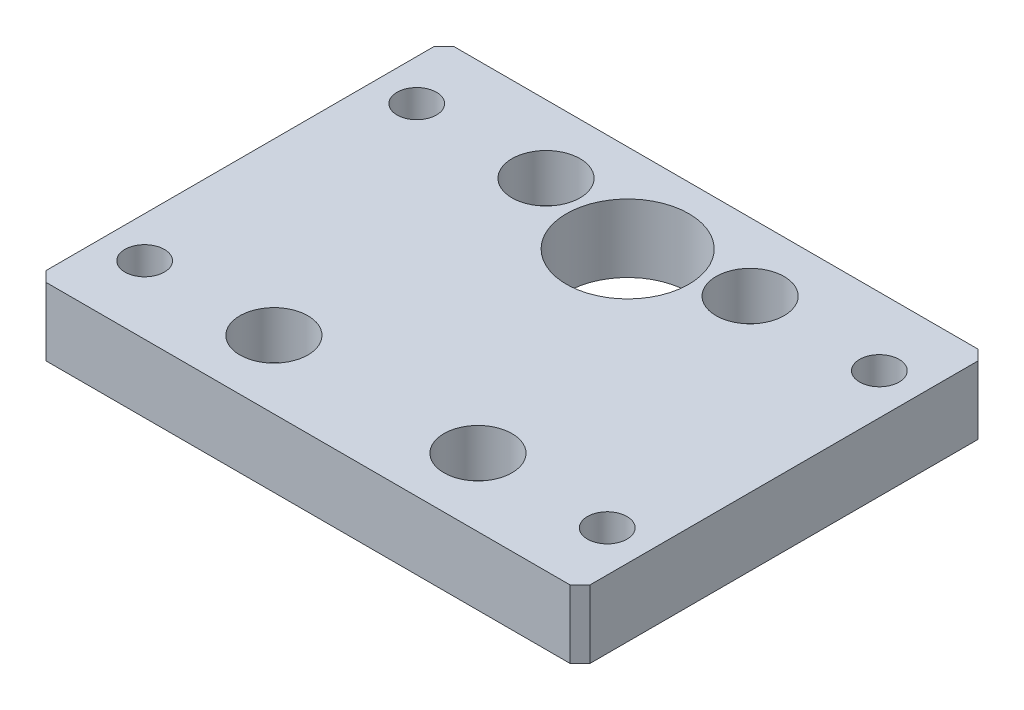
ISO-10303-21;
HEADER;
FILE_DESCRIPTION(('STEP AP214'),'2;1');
FILE_NAME('part.step','',(''),(''),'','','');
FILE_SCHEMA(('AUTOMOTIVE_DESIGN { 1 0 10303 214 1 1 1 1 }'));
ENDSEC;
DATA;
#1=APPLICATION_CONTEXT('core data for automotive mechanical design processes');
#2=APPLICATION_PROTOCOL_DEFINITION('international standard','automotive_design',2000,#1);
#3=PRODUCT_CONTEXT('',#1,'mechanical');
#4=PRODUCT('Part','Part','',(#3));
#5=PRODUCT_RELATED_PRODUCT_CATEGORY('part','',(#4));
#6=PRODUCT_DEFINITION_FORMATION('','',#4);
#7=PRODUCT_DEFINITION_CONTEXT('part definition',#1,'design');
#8=PRODUCT_DEFINITION('design','',#6,#7);
#9=PRODUCT_DEFINITION_SHAPE('','',#8);
#10=(LENGTH_UNIT() NAMED_UNIT(*) SI_UNIT(.MILLI.,.METRE.));
#11=(NAMED_UNIT(*) PLANE_ANGLE_UNIT() SI_UNIT($,.RADIAN.));
#12=(NAMED_UNIT(*) SI_UNIT($,.STERADIAN.) SOLID_ANGLE_UNIT());
#13=UNCERTAINTY_MEASURE_WITH_UNIT(LENGTH_MEASURE(1.E-05),#10,'distance_accuracy_value','');
#14=(GEOMETRIC_REPRESENTATION_CONTEXT(3) GLOBAL_UNCERTAINTY_ASSIGNED_CONTEXT((#13)) GLOBAL_UNIT_ASSIGNED_CONTEXT((#10,
#11,#12)) REPRESENTATION_CONTEXT('',''));
#15=CARTESIAN_POINT('',(0.,0.,0.));
#16=DIRECTION('',(0.,0.,1.));
#17=DIRECTION('',(1.,0.,0.));
#18=AXIS2_PLACEMENT_3D('',#15,#16,#17);
#19=CARTESIAN_POINT('',(-15.0000000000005,9.9999999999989,20.000000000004));
#20=DIRECTION('',(0.,-0.999999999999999,0.));
#21=DIRECTION('',(0.,0.,-1.));
#22=AXIS2_PLACEMENT_3D('',#19,#20,#21);
#23=CYLINDRICAL_SURFACE('',#22,2.9);
#24=CARTESIAN_POINT('',(-15.0000000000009,0.,20.0000000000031));
#25=DIRECTION('',(0.,0.999999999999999,0.));
#26=DIRECTION('',(0.,0.,-1.));
#27=AXIS2_PLACEMENT_3D('',#24,#25,#26);
#28=CIRCLE('',#27,2.9);
#29=CARTESIAN_POINT('',(-15.0000000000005,0.,17.100000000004));
#30=VERTEX_POINT('',#29);
#31=EDGE_CURVE('E226',#30,#30,#28,.T.);
#32=CARTESIAN_POINT('',(-15.0000000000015,3.00000000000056,20.0000000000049));
#33=DIRECTION('',(0.,0.999999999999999,0.));
#34=DIRECTION('',(0.,0.,1.));
#35=AXIS2_PLACEMENT_3D('',#32,#33,#34);
#36=CIRCLE('',#35,2.9);
#37=CARTESIAN_POINT('',(-15.0000000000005,3.00000000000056,17.100000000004));
#38=VERTEX_POINT('',#37);
#39=EDGE_CURVE('E160',#38,#38,#36,.T.);
#40=CARTESIAN_POINT('',(-15.0000000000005,0.,17.100000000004));
#41=CARTESIAN_POINT('',(-15.0000000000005,0.0312500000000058,17.100000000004));
#42=CARTESIAN_POINT('',(-15.0000000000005,0.0625000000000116,17.100000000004));
#43=CARTESIAN_POINT('',(-15.0000000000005,0.125000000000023,17.100000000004));
#44=CARTESIAN_POINT('',(-15.0000000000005,0.156250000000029,17.100000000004));
#45=CARTESIAN_POINT('',(-15.0000000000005,0.218750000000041,17.100000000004));
#46=CARTESIAN_POINT('',(-15.0000000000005,0.250000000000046,17.100000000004));
#47=CARTESIAN_POINT('',(-15.0000000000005,0.312500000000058,17.100000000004));
#48=CARTESIAN_POINT('',(-15.0000000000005,0.343750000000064,17.100000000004));
#49=CARTESIAN_POINT('',(-15.0000000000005,0.406250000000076,17.100000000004));
#50=CARTESIAN_POINT('',(-15.0000000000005,0.437500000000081,17.100000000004));
#51=CARTESIAN_POINT('',(-15.0000000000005,0.500000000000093,17.100000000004));
#52=CARTESIAN_POINT('',(-15.0000000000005,0.531250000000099,17.100000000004));
#53=CARTESIAN_POINT('',(-15.0000000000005,0.59375000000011,17.100000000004));
#54=CARTESIAN_POINT('',(-15.0000000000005,0.625000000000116,17.100000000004));
#55=CARTESIAN_POINT('',(-15.0000000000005,0.687500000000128,17.100000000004));
#56=CARTESIAN_POINT('',(-15.0000000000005,0.718750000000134,17.100000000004));
#57=CARTESIAN_POINT('',(-15.0000000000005,0.781250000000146,17.100000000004));
#58=CARTESIAN_POINT('',(-15.0000000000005,0.812500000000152,17.100000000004));
#59=CARTESIAN_POINT('',(-15.0000000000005,0.875000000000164,17.100000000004));
#60=CARTESIAN_POINT('',(-15.0000000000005,0.90625000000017,17.100000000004));
#61=CARTESIAN_POINT('',(-15.0000000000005,0.968750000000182,17.100000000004));
#62=CARTESIAN_POINT('',(-15.0000000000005,1.00000000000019,17.100000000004));
#63=CARTESIAN_POINT('',(-15.0000000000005,1.0625000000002,17.100000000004));
#64=CARTESIAN_POINT('',(-15.0000000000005,1.0937500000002,17.100000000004));
#65=CARTESIAN_POINT('',(-15.0000000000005,1.15625000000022,17.100000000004));
#66=CARTESIAN_POINT('',(-15.0000000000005,1.18750000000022,17.100000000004));
#67=CARTESIAN_POINT('',(-15.0000000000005,1.25000000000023,17.100000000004));
#68=CARTESIAN_POINT('',(-15.0000000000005,1.28125000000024,17.100000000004));
#69=CARTESIAN_POINT('',(-15.0000000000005,1.34375000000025,17.100000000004));
#70=CARTESIAN_POINT('',(-15.0000000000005,1.37500000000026,17.100000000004));
#71=CARTESIAN_POINT('',(-15.0000000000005,1.43750000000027,17.100000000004));
#72=CARTESIAN_POINT('',(-15.0000000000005,1.46875000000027,17.100000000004));
#73=CARTESIAN_POINT('',(-15.0000000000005,1.53125000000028,17.100000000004));
#74=CARTESIAN_POINT('',(-15.0000000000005,1.56250000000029,17.100000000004));
#75=CARTESIAN_POINT('',(-15.0000000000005,1.6250000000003,17.100000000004));
#76=CARTESIAN_POINT('',(-15.0000000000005,1.65625000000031,17.100000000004));
#77=CARTESIAN_POINT('',(-15.0000000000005,1.71875000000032,17.100000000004));
#78=CARTESIAN_POINT('',(-15.0000000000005,1.75000000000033,17.100000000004));
#79=CARTESIAN_POINT('',(-15.0000000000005,1.81250000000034,17.100000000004));
#80=CARTESIAN_POINT('',(-15.0000000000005,1.84375000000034,17.100000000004));
#81=CARTESIAN_POINT('',(-15.0000000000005,1.90625000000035,17.100000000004));
#82=CARTESIAN_POINT('',(-15.0000000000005,1.93750000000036,17.100000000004));
#83=CARTESIAN_POINT('',(-15.0000000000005,2.00000000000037,17.100000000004));
#84=CARTESIAN_POINT('',(-15.0000000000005,2.03125000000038,17.100000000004));
#85=CARTESIAN_POINT('',(-15.0000000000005,2.09375000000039,17.100000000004));
#86=CARTESIAN_POINT('',(-15.0000000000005,2.1250000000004,17.100000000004));
#87=CARTESIAN_POINT('',(-15.0000000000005,2.18750000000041,17.100000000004));
#88=CARTESIAN_POINT('',(-15.0000000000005,2.21875000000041,17.100000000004));
#89=CARTESIAN_POINT('',(-15.0000000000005,2.28125000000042,17.100000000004));
#90=CARTESIAN_POINT('',(-15.0000000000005,2.31250000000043,17.100000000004));
#91=CARTESIAN_POINT('',(-15.0000000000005,2.37500000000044,17.100000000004));
#92=CARTESIAN_POINT('',(-15.0000000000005,2.40625000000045,17.100000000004));
#93=CARTESIAN_POINT('',(-15.0000000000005,2.46875000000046,17.100000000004));
#94=CARTESIAN_POINT('',(-15.0000000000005,2.50000000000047,17.100000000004));
#95=CARTESIAN_POINT('',(-15.0000000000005,2.56250000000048,17.100000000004));
#96=CARTESIAN_POINT('',(-15.0000000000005,2.59375000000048,17.100000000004));
#97=CARTESIAN_POINT('',(-15.0000000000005,2.65625000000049,17.100000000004));
#98=CARTESIAN_POINT('',(-15.0000000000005,2.6875000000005,17.100000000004));
#99=CARTESIAN_POINT('',(-15.0000000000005,2.75000000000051,17.100000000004));
#100=CARTESIAN_POINT('',(-15.0000000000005,2.78125000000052,17.100000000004));
#101=CARTESIAN_POINT('',(-15.0000000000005,2.84375000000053,17.100000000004));
#102=CARTESIAN_POINT('',(-15.0000000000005,2.87500000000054,17.100000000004));
#103=CARTESIAN_POINT('',(-15.0000000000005,2.93750000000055,17.100000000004));
#104=CARTESIAN_POINT('',(-15.0000000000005,2.96875000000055,17.100000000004));
#105=CARTESIAN_POINT('',(-15.0000000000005,3.00000000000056,17.100000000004));
#106=B_SPLINE_CURVE_WITH_KNOTS('',3,(#40,#41,#42,#43,#44,#45,#46,#47,#48,#49,#50,#51,#52,#53,
#54,#55,#56,#57,#58,#59,#60,#61,#62,#63,#64,#65,#66,#67,#68,#69,#70,#71,#72,#73,#74,#75,#76,#77,
#78,#79,#80,#81,#82,#83,#84,#85,#86,#87,#88,#89,#90,#91,#92,#93,#94,#95,#96,#97,#98,#99,#100,
#101,#102,#103,#104,#105),.UNSPECIFIED.,.F.,.F.,(4,2,2,2,2,2,2,2,2,2,2,2,2,2,2,2,2,2,2,2,2,2,2,
2,2,2,2,2,2,2,2,2,4),(0.,0.0937500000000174,0.187500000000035,0.281250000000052,
0.37500000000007,0.468750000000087,0.562500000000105,0.656250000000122,0.750000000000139,
0.843750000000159,0.937500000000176,1.03125000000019,1.12500000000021,1.21875000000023,
1.31250000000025,1.40625000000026,1.50000000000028,1.5937500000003,1.68750000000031,
1.78125000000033,1.87500000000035,1.96875000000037,2.06250000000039,2.1562500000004,
2.25000000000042,2.34375000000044,2.43750000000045,2.53125000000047,2.62500000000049,
2.71875000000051,2.81250000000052,2.90625000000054,3.00000000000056),.UNSPECIFIED.);
#107=EDGE_CURVE('BSEAM36',#30,#38,#106,.T.);
#108=ORIENTED_EDGE('',*,*,#31,.F.);
#109=ORIENTED_EDGE('',*,*,#39,.T.);
#110=ORIENTED_EDGE('',*,*,#107,.T.);
#111=ORIENTED_EDGE('',*,*,#107,.F.);
#112=EDGE_LOOP('',(#108,#110,#109,#111));
#113=FACE_BOUND('',#112,.T.);
#114=ADVANCED_FACE('F36',(#113),#23,.F.);
#115=CARTESIAN_POINT('',(14.9999999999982,9.99999999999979,20.0000000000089));
#116=DIRECTION('',(0.,-0.999999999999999,0.));
#117=DIRECTION('',(0.,0.,-1.));
#118=AXIS2_PLACEMENT_3D('',#115,#116,#117);
#119=CYLINDRICAL_SURFACE('',#118,2.9);
#120=CARTESIAN_POINT('',(14.9999999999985,0.,20.0000000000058));
#121=DIRECTION('',(0.,0.999999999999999,0.));
#122=DIRECTION('',(0.,0.,1.));
#123=AXIS2_PLACEMENT_3D('',#120,#121,#122);
#124=CIRCLE('',#123,2.9);
#125=CARTESIAN_POINT('',(14.9999999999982,0.,17.1000000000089));
#126=VERTEX_POINT('',#125);
#127=EDGE_CURVE('E221',#126,#126,#124,.T.);
#128=CARTESIAN_POINT('',(14.9999999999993,3.000000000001,20.0000000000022));
#129=DIRECTION('',(0.,0.999999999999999,0.));
#130=DIRECTION('',(0.,0.,1.));
#131=AXIS2_PLACEMENT_3D('',#128,#129,#130);
#132=CIRCLE('',#131,2.9);
#133=CARTESIAN_POINT('',(14.9999999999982,3.000000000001,17.1000000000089));
#134=VERTEX_POINT('',#133);
#135=EDGE_CURVE('E155',#134,#134,#132,.T.);
#136=CARTESIAN_POINT('',(14.9999999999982,0.,17.1000000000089));
#137=CARTESIAN_POINT('',(14.9999999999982,0.0312500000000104,17.1000000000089));
#138=CARTESIAN_POINT('',(14.9999999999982,0.0625000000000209,17.1000000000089));
#139=CARTESIAN_POINT('',(14.9999999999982,0.125000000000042,17.1000000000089));
#140=CARTESIAN_POINT('',(14.9999999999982,0.156250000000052,17.1000000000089));
#141=CARTESIAN_POINT('',(14.9999999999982,0.218750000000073,17.1000000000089));
#142=CARTESIAN_POINT('',(14.9999999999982,0.250000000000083,17.1000000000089));
#143=CARTESIAN_POINT('',(14.9999999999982,0.312500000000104,17.1000000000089));
#144=CARTESIAN_POINT('',(14.9999999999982,0.343750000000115,17.1000000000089));
#145=CARTESIAN_POINT('',(14.9999999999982,0.406250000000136,17.1000000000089));
#146=CARTESIAN_POINT('',(14.9999999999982,0.437500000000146,17.1000000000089));
#147=CARTESIAN_POINT('',(14.9999999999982,0.500000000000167,17.1000000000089));
#148=CARTESIAN_POINT('',(14.9999999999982,0.531250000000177,17.1000000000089));
#149=CARTESIAN_POINT('',(14.9999999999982,0.593750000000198,17.1000000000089));
#150=CARTESIAN_POINT('',(14.9999999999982,0.625000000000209,17.1000000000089));
#151=CARTESIAN_POINT('',(14.9999999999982,0.68750000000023,17.1000000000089));
#152=CARTESIAN_POINT('',(14.9999999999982,0.71875000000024,17.1000000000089));
#153=CARTESIAN_POINT('',(14.9999999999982,0.781250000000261,17.1000000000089));
#154=CARTESIAN_POINT('',(14.9999999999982,0.812500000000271,17.1000000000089));
#155=CARTESIAN_POINT('',(14.9999999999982,0.875000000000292,17.1000000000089));
#156=CARTESIAN_POINT('',(14.9999999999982,0.906250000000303,17.1000000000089));
#157=CARTESIAN_POINT('',(14.9999999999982,0.968750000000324,17.1000000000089));
#158=CARTESIAN_POINT('',(14.9999999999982,1.00000000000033,17.1000000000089));
#159=CARTESIAN_POINT('',(14.9999999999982,1.06250000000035,17.1000000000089));
#160=CARTESIAN_POINT('',(14.9999999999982,1.09375000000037,17.1000000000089));
#161=CARTESIAN_POINT('',(14.9999999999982,1.15625000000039,17.1000000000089));
#162=CARTESIAN_POINT('',(14.9999999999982,1.1875000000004,17.1000000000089));
#163=CARTESIAN_POINT('',(14.9999999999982,1.25000000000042,17.1000000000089));
#164=CARTESIAN_POINT('',(14.9999999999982,1.28125000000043,17.1000000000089));
#165=CARTESIAN_POINT('',(14.9999999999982,1.34375000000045,17.1000000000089));
#166=CARTESIAN_POINT('',(14.9999999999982,1.37500000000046,17.1000000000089));
#167=CARTESIAN_POINT('',(14.9999999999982,1.43750000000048,17.1000000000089));
#168=CARTESIAN_POINT('',(14.9999999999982,1.46875000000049,17.1000000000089));
#169=CARTESIAN_POINT('',(14.9999999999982,1.53125000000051,17.1000000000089));
#170=CARTESIAN_POINT('',(14.9999999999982,1.56250000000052,17.1000000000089));
#171=CARTESIAN_POINT('',(14.9999999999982,1.62500000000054,17.1000000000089));
#172=CARTESIAN_POINT('',(14.9999999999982,1.65625000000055,17.1000000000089));
#173=CARTESIAN_POINT('',(14.9999999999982,1.71875000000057,17.1000000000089));
#174=CARTESIAN_POINT('',(14.9999999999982,1.75000000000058,17.1000000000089));
#175=CARTESIAN_POINT('',(14.9999999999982,1.81250000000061,17.1000000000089));
#176=CARTESIAN_POINT('',(14.9999999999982,1.84375000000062,17.1000000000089));
#177=CARTESIAN_POINT('',(14.9999999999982,1.90625000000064,17.1000000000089));
#178=CARTESIAN_POINT('',(14.9999999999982,1.93750000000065,17.1000000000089));
#179=CARTESIAN_POINT('',(14.9999999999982,2.00000000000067,17.1000000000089));
#180=CARTESIAN_POINT('',(14.9999999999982,2.03125000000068,17.1000000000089));
#181=CARTESIAN_POINT('',(14.9999999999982,2.0937500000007,17.1000000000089));
#182=CARTESIAN_POINT('',(14.9999999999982,2.12500000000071,17.1000000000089));
#183=CARTESIAN_POINT('',(14.9999999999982,2.18750000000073,17.1000000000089));
#184=CARTESIAN_POINT('',(14.9999999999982,2.21875000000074,17.1000000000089));
#185=CARTESIAN_POINT('',(14.9999999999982,2.28125000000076,17.1000000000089));
#186=CARTESIAN_POINT('',(14.9999999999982,2.31250000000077,17.1000000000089));
#187=CARTESIAN_POINT('',(14.9999999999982,2.37500000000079,17.1000000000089));
#188=CARTESIAN_POINT('',(14.9999999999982,2.4062500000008,17.1000000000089));
#189=CARTESIAN_POINT('',(14.9999999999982,2.46875000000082,17.1000000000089));
#190=CARTESIAN_POINT('',(14.9999999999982,2.50000000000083,17.1000000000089));
#191=CARTESIAN_POINT('',(14.9999999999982,2.56250000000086,17.1000000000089));
#192=CARTESIAN_POINT('',(14.9999999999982,2.59375000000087,17.1000000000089));
#193=CARTESIAN_POINT('',(14.9999999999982,2.65625000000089,17.1000000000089));
#194=CARTESIAN_POINT('',(14.9999999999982,2.6875000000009,17.1000000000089));
#195=CARTESIAN_POINT('',(14.9999999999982,2.75000000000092,17.1000000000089));
#196=CARTESIAN_POINT('',(14.9999999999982,2.78125000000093,17.1000000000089));
#197=CARTESIAN_POINT('',(14.9999999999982,2.84375000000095,17.1000000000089));
#198=CARTESIAN_POINT('',(14.9999999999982,2.87500000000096,17.1000000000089));
#199=CARTESIAN_POINT('',(14.9999999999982,2.93750000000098,17.1000000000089));
#200=CARTESIAN_POINT('',(14.9999999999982,2.96875000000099,17.1000000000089));
#201=CARTESIAN_POINT('',(14.9999999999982,3.000000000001,17.1000000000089));
#202=B_SPLINE_CURVE_WITH_KNOTS('',3,(#136,#137,#138,#139,#140,#141,#142,#143,#144,#145,#146,
#147,#148,#149,#150,#151,#152,#153,#154,#155,#156,#157,#158,#159,#160,#161,#162,#163,#164,#165,
#166,#167,#168,#169,#170,#171,#172,#173,#174,#175,#176,#177,#178,#179,#180,#181,#182,#183,#184,
#185,#186,#187,#188,#189,#190,#191,#192,#193,#194,#195,#196,#197,#198,#199,#200,#201),
.UNSPECIFIED.,.F.,.F.,(4,2,2,2,2,2,2,2,2,2,2,2,2,2,2,2,2,2,2,2,2,2,2,2,2,2,2,2,2,2,2,2,4),(0.,
0.0937500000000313,0.187500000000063,0.281250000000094,0.375000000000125,0.468750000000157,
0.562500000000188,0.656250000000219,0.75000000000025,0.843750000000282,0.937500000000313,
1.03125000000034,1.12500000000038,1.21875000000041,1.31250000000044,1.40625000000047,
1.5000000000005,1.59375000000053,1.68750000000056,1.78125000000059,1.87500000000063,
1.96875000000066,2.06250000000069,2.15625000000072,2.25000000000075,2.34375000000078,
2.43750000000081,2.53125000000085,2.62500000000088,2.71875000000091,2.81250000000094,
2.90625000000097,3.000000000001),.UNSPECIFIED.);
#203=EDGE_CURVE('BSEAM305',#126,#134,#202,.T.);
#204=ORIENTED_EDGE('',*,*,#127,.F.);
#205=ORIENTED_EDGE('',*,*,#135,.T.);
#206=ORIENTED_EDGE('',*,*,#203,.T.);
#207=ORIENTED_EDGE('',*,*,#203,.F.);
#208=EDGE_LOOP('',(#204,#206,#205,#207));
#209=FACE_BOUND('',#208,.T.);
#210=ADVANCED_FACE('F305',(#209),#119,.F.);
#211=CARTESIAN_POINT('',(14.9999999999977,9.99999999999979,-19.9999999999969));
#212=DIRECTION('',(0.,-0.999999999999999,0.));
#213=DIRECTION('',(0.,0.,-1.));
#214=AXIS2_PLACEMENT_3D('',#211,#212,#213);
#215=CYLINDRICAL_SURFACE('',#214,2.9);
#216=CARTESIAN_POINT('',(14.9999999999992,4.44089209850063E-13,-19.9999999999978));
#217=DIRECTION('',(0.,0.999999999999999,0.));
#218=DIRECTION('',(0.,0.,-1.));
#219=AXIS2_PLACEMENT_3D('',#216,#217,#218);
#220=CIRCLE('',#219,2.9);
#221=CARTESIAN_POINT('',(14.9999999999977,4.44089209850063E-13,-22.8999999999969));
#222=VERTEX_POINT('',#221);
#223=EDGE_CURVE('E208',#222,#222,#220,.T.);
#224=CARTESIAN_POINT('',(14.9999999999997,3.00000000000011,-19.9999999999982));
#225=DIRECTION('',(0.,0.999999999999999,0.));
#226=DIRECTION('',(0.,0.,1.));
#227=AXIS2_PLACEMENT_3D('',#224,#225,#226);
#228=CIRCLE('',#227,2.9);
#229=CARTESIAN_POINT('',(14.9999999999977,3.00000000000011,-22.8999999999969));
#230=VERTEX_POINT('',#229);
#231=EDGE_CURVE('E150',#230,#230,#228,.T.);
#232=CARTESIAN_POINT('',(14.9999999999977,4.44089209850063E-13,-22.8999999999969));
#233=CARTESIAN_POINT('',(14.9999999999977,0.0312500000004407,-22.8999999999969));
#234=CARTESIAN_POINT('',(14.9999999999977,0.0625000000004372,-22.8999999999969));
#235=CARTESIAN_POINT('',(14.9999999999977,0.12500000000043,-22.8999999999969));
#236=CARTESIAN_POINT('',(14.9999999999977,0.156250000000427,-22.8999999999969));
#237=CARTESIAN_POINT('',(14.9999999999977,0.21875000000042,-22.8999999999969));
#238=CARTESIAN_POINT('',(14.9999999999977,0.250000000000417,-22.8999999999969));
#239=CARTESIAN_POINT('',(14.9999999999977,0.31250000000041,-22.8999999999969));
#240=CARTESIAN_POINT('',(14.9999999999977,0.343750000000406,-22.8999999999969));
#241=CARTESIAN_POINT('',(14.9999999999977,0.406250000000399,-22.8999999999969));
#242=CARTESIAN_POINT('',(14.9999999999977,0.437500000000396,-22.8999999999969));
#243=CARTESIAN_POINT('',(14.9999999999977,0.500000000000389,-22.8999999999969));
#244=CARTESIAN_POINT('',(14.9999999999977,0.531250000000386,-22.8999999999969));
#245=CARTESIAN_POINT('',(14.9999999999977,0.593750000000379,-22.8999999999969));
#246=CARTESIAN_POINT('',(14.9999999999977,0.625000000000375,-22.8999999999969));
#247=CARTESIAN_POINT('',(14.9999999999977,0.687500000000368,-22.8999999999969));
#248=CARTESIAN_POINT('',(14.9999999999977,0.718750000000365,-22.8999999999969));
#249=CARTESIAN_POINT('',(14.9999999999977,0.781250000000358,-22.8999999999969));
#250=CARTESIAN_POINT('',(14.9999999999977,0.812500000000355,-22.8999999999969));
#251=CARTESIAN_POINT('',(14.9999999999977,0.875000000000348,-22.8999999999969));
#252=CARTESIAN_POINT('',(14.9999999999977,0.906250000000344,-22.8999999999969));
#253=CARTESIAN_POINT('',(14.9999999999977,0.968750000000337,-22.8999999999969));
#254=CARTESIAN_POINT('',(14.9999999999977,1.00000000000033,-22.8999999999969));
#255=CARTESIAN_POINT('',(14.9999999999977,1.06250000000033,-22.8999999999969));
#256=CARTESIAN_POINT('',(14.9999999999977,1.09375000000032,-22.8999999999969));
#257=CARTESIAN_POINT('',(14.9999999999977,1.15625000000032,-22.8999999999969));
#258=CARTESIAN_POINT('',(14.9999999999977,1.18750000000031,-22.8999999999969));
#259=CARTESIAN_POINT('',(14.9999999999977,1.25000000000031,-22.8999999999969));
#260=CARTESIAN_POINT('',(14.9999999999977,1.2812500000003,-22.8999999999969));
#261=CARTESIAN_POINT('',(14.9999999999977,1.3437500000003,-22.8999999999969));
#262=CARTESIAN_POINT('',(14.9999999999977,1.37500000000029,-22.8999999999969));
#263=CARTESIAN_POINT('',(14.9999999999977,1.43750000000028,-22.8999999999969));
#264=CARTESIAN_POINT('',(14.9999999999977,1.46875000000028,-22.8999999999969));
#265=CARTESIAN_POINT('',(14.9999999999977,1.53125000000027,-22.8999999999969));
#266=CARTESIAN_POINT('',(14.9999999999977,1.56250000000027,-22.8999999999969));
#267=CARTESIAN_POINT('',(14.9999999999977,1.62500000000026,-22.8999999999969));
#268=CARTESIAN_POINT('',(14.9999999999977,1.65625000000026,-22.8999999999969));
#269=CARTESIAN_POINT('',(14.9999999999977,1.71875000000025,-22.8999999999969));
#270=CARTESIAN_POINT('',(14.9999999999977,1.75000000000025,-22.8999999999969));
#271=CARTESIAN_POINT('',(14.9999999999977,1.81250000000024,-22.8999999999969));
#272=CARTESIAN_POINT('',(14.9999999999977,1.84375000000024,-22.8999999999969));
#273=CARTESIAN_POINT('',(14.9999999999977,1.90625000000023,-22.8999999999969));
#274=CARTESIAN_POINT('',(14.9999999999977,1.93750000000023,-22.8999999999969));
#275=CARTESIAN_POINT('',(14.9999999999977,2.00000000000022,-22.8999999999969));
#276=CARTESIAN_POINT('',(14.9999999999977,2.03125000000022,-22.8999999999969));
#277=CARTESIAN_POINT('',(14.9999999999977,2.09375000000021,-22.8999999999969));
#278=CARTESIAN_POINT('',(14.9999999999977,2.12500000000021,-22.8999999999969));
#279=CARTESIAN_POINT('',(14.9999999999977,2.1875000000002,-22.8999999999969));
#280=CARTESIAN_POINT('',(14.9999999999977,2.2187500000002,-22.8999999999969));
#281=CARTESIAN_POINT('',(14.9999999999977,2.28125000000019,-22.8999999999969));
#282=CARTESIAN_POINT('',(14.9999999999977,2.31250000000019,-22.8999999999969));
#283=CARTESIAN_POINT('',(14.9999999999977,2.37500000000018,-22.8999999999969));
#284=CARTESIAN_POINT('',(14.9999999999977,2.40625000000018,-22.8999999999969));
#285=CARTESIAN_POINT('',(14.9999999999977,2.46875000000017,-22.8999999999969));
#286=CARTESIAN_POINT('',(14.9999999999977,2.50000000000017,-22.8999999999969));
#287=CARTESIAN_POINT('',(14.9999999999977,2.56250000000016,-22.8999999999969));
#288=CARTESIAN_POINT('',(14.9999999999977,2.59375000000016,-22.8999999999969));
#289=CARTESIAN_POINT('',(14.9999999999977,2.65625000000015,-22.8999999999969));
#290=CARTESIAN_POINT('',(14.9999999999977,2.68750000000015,-22.8999999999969));
#291=CARTESIAN_POINT('',(14.9999999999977,2.75000000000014,-22.8999999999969));
#292=CARTESIAN_POINT('',(14.9999999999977,2.78125000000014,-22.8999999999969));
#293=CARTESIAN_POINT('',(14.9999999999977,2.84375000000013,-22.8999999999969));
#294=CARTESIAN_POINT('',(14.9999999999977,2.87500000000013,-22.8999999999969));
#295=CARTESIAN_POINT('',(14.9999999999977,2.93750000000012,-22.8999999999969));
#296=CARTESIAN_POINT('',(14.9999999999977,2.96875000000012,-22.8999999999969));
#297=CARTESIAN_POINT('',(14.9999999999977,3.00000000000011,-22.8999999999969));
#298=B_SPLINE_CURVE_WITH_KNOTS('',3,(#232,#233,#234,#235,#236,#237,#238,#239,#240,#241,#242,
#243,#244,#245,#246,#247,#248,#249,#250,#251,#252,#253,#254,#255,#256,#257,#258,#259,#260,#261,
#262,#263,#264,#265,#266,#267,#268,#269,#270,#271,#272,#273,#274,#275,#276,#277,#278,#279,#280,
#281,#282,#283,#284,#285,#286,#287,#288,#289,#290,#291,#292,#293,#294,#295,#296,#297),
.UNSPECIFIED.,.F.,.F.,(4,2,2,2,2,2,2,2,2,2,2,2,2,2,2,2,2,2,2,2,2,2,2,2,2,2,2,2,2,2,2,2,4),(0.,
0.0937499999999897,0.187499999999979,0.281249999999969,0.374999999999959,0.468749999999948,
0.562499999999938,0.656249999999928,0.749999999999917,0.843749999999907,0.937499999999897,
1.03124999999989,1.12499999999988,1.21874999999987,1.31249999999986,1.40624999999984,
1.49999999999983,1.59374999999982,1.68749999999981,1.7812499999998,1.87499999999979,
1.96874999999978,2.06249999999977,2.15624999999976,2.24999999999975,2.34374999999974,
2.43749999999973,2.53124999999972,2.62499999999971,2.7187499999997,2.81249999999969,
2.90624999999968,2.99999999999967),.UNSPECIFIED.);
#299=EDGE_CURVE('BSEAM311',#222,#230,#298,.T.);
#300=ORIENTED_EDGE('',*,*,#223,.F.);
#301=ORIENTED_EDGE('',*,*,#231,.T.);
#302=ORIENTED_EDGE('',*,*,#299,.T.);
#303=ORIENTED_EDGE('',*,*,#299,.F.);
#304=EDGE_LOOP('',(#300,#302,#301,#303));
#305=FACE_BOUND('',#304,.T.);
#306=ADVANCED_FACE('F311',(#305),#215,.F.);
#307=CARTESIAN_POINT('',(-15.0000000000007,9.99999999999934,-19.9999999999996));
#308=DIRECTION('',(0.,-0.999999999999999,0.));
#309=DIRECTION('',(0.,0.,-1.));
#310=AXIS2_PLACEMENT_3D('',#307,#308,#309);
#311=CYLINDRICAL_SURFACE('',#310,2.9);
#312=CARTESIAN_POINT('',(-15.0000000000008,0.,-19.9999999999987));
#313=DIRECTION('',(0.,0.999999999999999,0.));
#314=DIRECTION('',(0.,0.,1.));
#315=AXIS2_PLACEMENT_3D('',#312,#313,#314);
#316=CIRCLE('',#315,2.9);
#317=CARTESIAN_POINT('',(-15.0000000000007,0.,-22.8999999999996));
#318=VERTEX_POINT('',#317);
#319=EDGE_CURVE('E204',#318,#318,#316,.T.);
#320=CARTESIAN_POINT('',(-15.0000000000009,3.00000000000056,-19.9999999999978));
#321=DIRECTION('',(0.,0.999999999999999,0.));
#322=DIRECTION('',(0.,0.,1.));
#323=AXIS2_PLACEMENT_3D('',#320,#321,#322);
#324=CIRCLE('',#323,2.9);
#325=CARTESIAN_POINT('',(-15.0000000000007,3.00000000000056,-22.8999999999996));
#326=VERTEX_POINT('',#325);
#327=EDGE_CURVE('E145',#326,#326,#324,.T.);
#328=CARTESIAN_POINT('',(-15.0000000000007,0.,-22.8999999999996));
#329=CARTESIAN_POINT('',(-15.0000000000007,0.0312500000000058,-22.8999999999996));
#330=CARTESIAN_POINT('',(-15.0000000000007,0.0625000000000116,-22.8999999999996));
#331=CARTESIAN_POINT('',(-15.0000000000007,0.125000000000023,-22.8999999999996));
#332=CARTESIAN_POINT('',(-15.0000000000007,0.156250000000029,-22.8999999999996));
#333=CARTESIAN_POINT('',(-15.0000000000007,0.218750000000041,-22.8999999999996));
#334=CARTESIAN_POINT('',(-15.0000000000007,0.250000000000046,-22.8999999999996));
#335=CARTESIAN_POINT('',(-15.0000000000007,0.312500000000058,-22.8999999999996));
#336=CARTESIAN_POINT('',(-15.0000000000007,0.343750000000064,-22.8999999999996));
#337=CARTESIAN_POINT('',(-15.0000000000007,0.406250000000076,-22.8999999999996));
#338=CARTESIAN_POINT('',(-15.0000000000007,0.437500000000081,-22.8999999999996));
#339=CARTESIAN_POINT('',(-15.0000000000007,0.500000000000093,-22.8999999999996));
#340=CARTESIAN_POINT('',(-15.0000000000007,0.531250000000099,-22.8999999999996));
#341=CARTESIAN_POINT('',(-15.0000000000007,0.59375000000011,-22.8999999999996));
#342=CARTESIAN_POINT('',(-15.0000000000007,0.625000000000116,-22.8999999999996));
#343=CARTESIAN_POINT('',(-15.0000000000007,0.687500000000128,-22.8999999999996));
#344=CARTESIAN_POINT('',(-15.0000000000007,0.718750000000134,-22.8999999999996));
#345=CARTESIAN_POINT('',(-15.0000000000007,0.781250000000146,-22.8999999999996));
#346=CARTESIAN_POINT('',(-15.0000000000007,0.812500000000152,-22.8999999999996));
#347=CARTESIAN_POINT('',(-15.0000000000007,0.875000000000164,-22.8999999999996));
#348=CARTESIAN_POINT('',(-15.0000000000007,0.90625000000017,-22.8999999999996));
#349=CARTESIAN_POINT('',(-15.0000000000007,0.968750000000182,-22.8999999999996));
#350=CARTESIAN_POINT('',(-15.0000000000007,1.00000000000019,-22.8999999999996));
#351=CARTESIAN_POINT('',(-15.0000000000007,1.0625000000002,-22.8999999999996));
#352=CARTESIAN_POINT('',(-15.0000000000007,1.0937500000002,-22.8999999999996));
#353=CARTESIAN_POINT('',(-15.0000000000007,1.15625000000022,-22.8999999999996));
#354=CARTESIAN_POINT('',(-15.0000000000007,1.18750000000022,-22.8999999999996));
#355=CARTESIAN_POINT('',(-15.0000000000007,1.25000000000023,-22.8999999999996));
#356=CARTESIAN_POINT('',(-15.0000000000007,1.28125000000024,-22.8999999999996));
#357=CARTESIAN_POINT('',(-15.0000000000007,1.34375000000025,-22.8999999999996));
#358=CARTESIAN_POINT('',(-15.0000000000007,1.37500000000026,-22.8999999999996));
#359=CARTESIAN_POINT('',(-15.0000000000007,1.43750000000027,-22.8999999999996));
#360=CARTESIAN_POINT('',(-15.0000000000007,1.46875000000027,-22.8999999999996));
#361=CARTESIAN_POINT('',(-15.0000000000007,1.53125000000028,-22.8999999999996));
#362=CARTESIAN_POINT('',(-15.0000000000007,1.56250000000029,-22.8999999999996));
#363=CARTESIAN_POINT('',(-15.0000000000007,1.6250000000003,-22.8999999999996));
#364=CARTESIAN_POINT('',(-15.0000000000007,1.65625000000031,-22.8999999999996));
#365=CARTESIAN_POINT('',(-15.0000000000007,1.71875000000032,-22.8999999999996));
#366=CARTESIAN_POINT('',(-15.0000000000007,1.75000000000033,-22.8999999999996));
#367=CARTESIAN_POINT('',(-15.0000000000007,1.81250000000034,-22.8999999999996));
#368=CARTESIAN_POINT('',(-15.0000000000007,1.84375000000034,-22.8999999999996));
#369=CARTESIAN_POINT('',(-15.0000000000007,1.90625000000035,-22.8999999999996));
#370=CARTESIAN_POINT('',(-15.0000000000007,1.93750000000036,-22.8999999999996));
#371=CARTESIAN_POINT('',(-15.0000000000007,2.00000000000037,-22.8999999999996));
#372=CARTESIAN_POINT('',(-15.0000000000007,2.03125000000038,-22.8999999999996));
#373=CARTESIAN_POINT('',(-15.0000000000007,2.09375000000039,-22.8999999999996));
#374=CARTESIAN_POINT('',(-15.0000000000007,2.1250000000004,-22.8999999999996));
#375=CARTESIAN_POINT('',(-15.0000000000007,2.18750000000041,-22.8999999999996));
#376=CARTESIAN_POINT('',(-15.0000000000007,2.21875000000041,-22.8999999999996));
#377=CARTESIAN_POINT('',(-15.0000000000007,2.28125000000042,-22.8999999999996));
#378=CARTESIAN_POINT('',(-15.0000000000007,2.31250000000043,-22.8999999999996));
#379=CARTESIAN_POINT('',(-15.0000000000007,2.37500000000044,-22.8999999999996));
#380=CARTESIAN_POINT('',(-15.0000000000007,2.40625000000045,-22.8999999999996));
#381=CARTESIAN_POINT('',(-15.0000000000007,2.46875000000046,-22.8999999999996));
#382=CARTESIAN_POINT('',(-15.0000000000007,2.50000000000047,-22.8999999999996));
#383=CARTESIAN_POINT('',(-15.0000000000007,2.56250000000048,-22.8999999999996));
#384=CARTESIAN_POINT('',(-15.0000000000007,2.59375000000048,-22.8999999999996));
#385=CARTESIAN_POINT('',(-15.0000000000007,2.65625000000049,-22.8999999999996));
#386=CARTESIAN_POINT('',(-15.0000000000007,2.6875000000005,-22.8999999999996));
#387=CARTESIAN_POINT('',(-15.0000000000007,2.75000000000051,-22.8999999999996));
#388=CARTESIAN_POINT('',(-15.0000000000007,2.78125000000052,-22.8999999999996));
#389=CARTESIAN_POINT('',(-15.0000000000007,2.84375000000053,-22.8999999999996));
#390=CARTESIAN_POINT('',(-15.0000000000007,2.87500000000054,-22.8999999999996));
#391=CARTESIAN_POINT('',(-15.0000000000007,2.93750000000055,-22.8999999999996));
#392=CARTESIAN_POINT('',(-15.0000000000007,2.96875000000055,-22.8999999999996));
#393=CARTESIAN_POINT('',(-15.0000000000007,3.00000000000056,-22.8999999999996));
#394=B_SPLINE_CURVE_WITH_KNOTS('',3,(#328,#329,#330,#331,#332,#333,#334,#335,#336,#337,#338,
#339,#340,#341,#342,#343,#344,#345,#346,#347,#348,#349,#350,#351,#352,#353,#354,#355,#356,#357,
#358,#359,#360,#361,#362,#363,#364,#365,#366,#367,#368,#369,#370,#371,#372,#373,#374,#375,#376,
#377,#378,#379,#380,#381,#382,#383,#384,#385,#386,#387,#388,#389,#390,#391,#392,#393),
.UNSPECIFIED.,.F.,.F.,(4,2,2,2,2,2,2,2,2,2,2,2,2,2,2,2,2,2,2,2,2,2,2,2,2,2,2,2,2,2,2,2,4),(0.,
0.0937500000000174,0.187500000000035,0.281250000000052,0.37500000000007,0.468750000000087,
0.562500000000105,0.656250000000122,0.750000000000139,0.843750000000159,0.937500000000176,
1.03125000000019,1.12500000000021,1.21875000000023,1.31250000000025,1.40625000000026,
1.50000000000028,1.5937500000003,1.68750000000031,1.78125000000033,1.87500000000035,
1.96875000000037,2.06250000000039,2.1562500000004,2.25000000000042,2.34375000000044,
2.43750000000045,2.53125000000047,2.62500000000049,2.71875000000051,2.81250000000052,
2.90625000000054,3.00000000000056),.UNSPECIFIED.);
#395=EDGE_CURVE('BSEAM270',#318,#326,#394,.T.);
#396=ORIENTED_EDGE('',*,*,#319,.F.);
#397=ORIENTED_EDGE('',*,*,#327,.T.);
#398=ORIENTED_EDGE('',*,*,#395,.T.);
#399=ORIENTED_EDGE('',*,*,#395,.F.);
#400=EDGE_LOOP('',(#396,#398,#397,#399));
#401=FACE_BOUND('',#400,.T.);
#402=ADVANCED_FACE('F270',(#401),#311,.F.);
#403=CARTESIAN_POINT('',(-8.88178419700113E-13,9.99999999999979,3.5527136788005E-12));
#404=DIRECTION('',(0.,0.999999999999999,0.));
#405=DIRECTION('',(0.,0.,1.));
#406=AXIS2_PLACEMENT_3D('',#403,#404,#405);
#407=PLANE('',#406);
#408=CARTESIAN_POINT('',(-15.0000000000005,9.9999999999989,20.000000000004));
#409=DIRECTION('',(0.,0.999999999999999,0.));
#410=DIRECTION('',(0.,0.,1.));
#411=AXIS2_PLACEMENT_3D('',#408,#409,#410);
#412=CIRCLE('',#411,5.);
#413=CARTESIAN_POINT('',(-15.0000000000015,9.9999999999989,25.0000000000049));
#414=VERTEX_POINT('',#413);
#415=EDGE_CURVE('E252',#414,#414,#412,.T.);
#416=ORIENTED_EDGE('',*,*,#415,.F.);
#417=EDGE_LOOP('',(#416));
#418=FACE_BOUND('',#417,.T.);
#419=CARTESIAN_POINT('',(14.9999999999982,9.99999999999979,20.0000000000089));
#420=DIRECTION('',(0.,0.999999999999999,0.));
#421=DIRECTION('',(0.,0.,1.));
#422=AXIS2_PLACEMENT_3D('',#419,#420,#421);
#423=CIRCLE('',#422,5.);
#424=CARTESIAN_POINT('',(14.9999999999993,9.99999999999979,25.0000000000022));
#425=VERTEX_POINT('',#424);
#426=EDGE_CURVE('E163',#425,#425,#423,.T.);
#427=ORIENTED_EDGE('',*,*,#426,.F.);
#428=EDGE_LOOP('',(#427));
#429=FACE_BOUND('',#428,.T.);
#430=CARTESIAN_POINT('',(14.9999999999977,9.99999999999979,-19.9999999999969));
#431=DIRECTION('',(0.,0.999999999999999,0.));
#432=DIRECTION('',(0.,0.,1.));
#433=AXIS2_PLACEMENT_3D('',#430,#431,#432);
#434=CIRCLE('',#433,5.);
#435=CARTESIAN_POINT('',(14.9999999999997,9.99999999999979,-14.9999999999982));
#436=VERTEX_POINT('',#435);
#437=EDGE_CURVE('E158',#436,#436,#434,.T.);
#438=ORIENTED_EDGE('',*,*,#437,.F.);
#439=EDGE_LOOP('',(#438));
#440=FACE_BOUND('',#439,.T.);
#441=CARTESIAN_POINT('',(-15.0000000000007,9.99999999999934,-19.9999999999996));
#442=DIRECTION('',(0.,0.999999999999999,0.));
#443=DIRECTION('',(0.,0.,1.));
#444=AXIS2_PLACEMENT_3D('',#441,#442,#443);
#445=CIRCLE('',#444,5.);
#446=CARTESIAN_POINT('',(-15.0000000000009,9.99999999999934,-14.9999999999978));
#447=VERTEX_POINT('',#446);
#448=EDGE_CURVE('E153',#447,#447,#445,.T.);
#449=ORIENTED_EDGE('',*,*,#448,.F.);
#450=EDGE_LOOP('',(#449));
#451=FACE_BOUND('',#450,.T.);
#452=CARTESIAN_POINT('',(-34.0000000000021,10.0000000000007,20.0000000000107));
#453=DIRECTION('',(0.,0.999999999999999,0.));
#454=DIRECTION('',(0.,0.,-1.));
#455=AXIS2_PLACEMENT_3D('',#452,#453,#454);
#456=CIRCLE('',#455,2.9);
#457=CARTESIAN_POINT('',(-34.0000000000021,10.0000000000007,17.1000000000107));
#458=VERTEX_POINT('',#457);
#459=EDGE_CURVE('E229',#458,#458,#456,.T.);
#460=ORIENTED_EDGE('',*,*,#459,.F.);
#461=EDGE_LOOP('',(#460));
#462=FACE_BOUND('',#461,.T.);
#463=CARTESIAN_POINT('',(33.9999999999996,10.0000000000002,-19.9999999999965));
#464=DIRECTION('',(0.,0.999999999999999,0.));
#465=DIRECTION('',(0.,0.,-1.));
#466=AXIS2_PLACEMENT_3D('',#463,#464,#465);
#467=CIRCLE('',#466,2.9);
#468=CARTESIAN_POINT('',(33.9999999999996,10.0000000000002,-22.8999999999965));
#469=VERTEX_POINT('',#468);
#470=EDGE_CURVE('E211',#469,#469,#467,.T.);
#471=ORIENTED_EDGE('',*,*,#470,.F.);
#472=EDGE_LOOP('',(#471));
#473=FACE_BOUND('',#472,.T.);
#474=DIRECTION('',(-1.,0.,0.));
#475=VECTOR('',#474,1.);
#476=CARTESIAN_POINT('',(39.9999999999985,10.0000000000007,-29.9999999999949));
#477=LINE('',#476,#475);
#478=CARTESIAN_POINT('',(38.4999999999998,10.0000000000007,-29.9999999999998));
#479=VERTEX_POINT('',#478);
#480=CARTESIAN_POINT('',(-38.5000000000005,9.99999999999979,-29.999999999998));
#481=VERTEX_POINT('',#480);
#482=EDGE_CURVE('E139',#479,#481,#477,.T.);
#483=ORIENTED_EDGE('',*,*,#482,.T.);
#484=DIRECTION('',(0.707106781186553,0.,-0.707106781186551));
#485=VECTOR('',#484,1.);
#486=CARTESIAN_POINT('',(-34.2500000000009,9.99999999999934,-34.2499999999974));
#487=LINE('',#486,#485);
#488=CARTESIAN_POINT('',(-40.0000000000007,9.99999999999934,-28.4999999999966));
#489=VERTEX_POINT('',#488);
#490=EDGE_CURVE('E178',#481,#489,#487,.F.);
#491=ORIENTED_EDGE('',*,*,#490,.T.);
#492=DIRECTION('',(0.,0.,1.));
#493=VECTOR('',#492,1.);
#494=CARTESIAN_POINT('',(-40.0000000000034,9.99999999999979,30.0000000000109));
#495=LINE('',#494,#493);
#496=CARTESIAN_POINT('',(-40.0000000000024,10.0000000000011,28.5000000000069));
#497=VERTEX_POINT('',#496);
#498=EDGE_CURVE('E122',#489,#497,#495,.T.);
#499=ORIENTED_EDGE('',*,*,#498,.T.);
#500=DIRECTION('',(-0.707106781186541,0.,-0.707106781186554));
#501=VECTOR('',#500,1.);
#502=CARTESIAN_POINT('',(-34.2500000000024,9.99999999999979,34.2500000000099));
#503=LINE('',#502,#501);
#504=CARTESIAN_POINT('',(-38.5000000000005,10.0000000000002,30.0000000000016));
#505=VERTEX_POINT('',#504);
#506=EDGE_CURVE('E176',#497,#505,#503,.F.);
#507=ORIENTED_EDGE('',*,*,#506,.T.);
#508=DIRECTION('',(1.,0.,0.));
#509=VECTOR('',#508,1.);
#510=CARTESIAN_POINT('',(39.999999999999,10.0000000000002,30.0000000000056));
#511=LINE('',#510,#509);
#512=CARTESIAN_POINT('',(38.4999999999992,10.0000000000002,30.0000000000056));
#513=VERTEX_POINT('',#512);
#514=EDGE_CURVE('E189',#505,#513,#511,.T.);
#515=ORIENTED_EDGE('',*,*,#514,.T.);
#516=DIRECTION('',(-0.707106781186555,0.,0.707106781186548));
#517=VECTOR('',#516,1.);
#518=CARTESIAN_POINT('',(34.2499999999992,10.0000000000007,34.2500000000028));
#519=LINE('',#518,#517);
#520=CARTESIAN_POINT('',(39.9999999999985,10.0000000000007,28.5000000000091));
#521=VERTEX_POINT('',#520);
#522=EDGE_CURVE('E57',#513,#521,#519,.F.);
#523=ORIENTED_EDGE('',*,*,#522,.T.);
#524=DIRECTION('',(0.,0.,-1.));
#525=VECTOR('',#524,1.);
#526=CARTESIAN_POINT('',(39.999999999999,10.0000000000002,30.0000000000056));
#527=LINE('',#526,#525);
#528=CARTESIAN_POINT('',(39.9999999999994,10.0000000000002,-28.4999999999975));
#529=VERTEX_POINT('',#528);
#530=EDGE_CURVE('E197',#521,#529,#527,.T.);
#531=ORIENTED_EDGE('',*,*,#530,.T.);
#532=DIRECTION('',(0.707106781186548,0.,0.707106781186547));
#533=VECTOR('',#532,1.);
#534=CARTESIAN_POINT('',(34.2499999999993,9.99999999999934,-34.2499999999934));
#535=LINE('',#534,#533);
#536=EDGE_CURVE('E173',#529,#479,#535,.F.);
#537=ORIENTED_EDGE('',*,*,#536,.T.);
#538=EDGE_LOOP('',(#483,#491,#499,#507,#515,#523,#531,#537));
#539=FACE_BOUND('',#538,.T.);
#540=CARTESIAN_POINT('',(-34.0000000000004,10.0000000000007,-19.9999999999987));
#541=DIRECTION('',(0.,0.999999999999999,0.));
#542=DIRECTION('',(0.,0.,1.));
#543=AXIS2_PLACEMENT_3D('',#540,#541,#542);
#544=CIRCLE('',#543,2.9);
#545=CARTESIAN_POINT('',(-34.0000000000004,10.0000000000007,-22.8999999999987));
#546=VERTEX_POINT('',#545);
#547=EDGE_CURVE('E130',#546,#546,#544,.T.);
#548=ORIENTED_EDGE('',*,*,#547,.F.);
#549=EDGE_LOOP('',(#548));
#550=FACE_BOUND('',#549,.T.);
#551=CARTESIAN_POINT('',(33.9999999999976,10.0000000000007,20.0000000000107));
#552=DIRECTION('',(0.,0.999999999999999,0.));
#553=DIRECTION('',(0.,0.,1.));
#554=AXIS2_PLACEMENT_3D('',#551,#552,#553);
#555=CIRCLE('',#554,2.9);
#556=CARTESIAN_POINT('',(33.9999999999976,10.0000000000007,17.1000000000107));
#557=VERTEX_POINT('',#556);
#558=EDGE_CURVE('E215',#557,#557,#555,.T.);
#559=ORIENTED_EDGE('',*,*,#558,.F.);
#560=EDGE_LOOP('',(#559));
#561=FACE_BOUND('',#560,.T.);
#562=CARTESIAN_POINT('',(-5.55111512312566E-13,10.0000000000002,-16.9999999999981));
#563=DIRECTION('',(0.,0.999999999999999,0.));
#564=DIRECTION('',(0.,0.,1.));
#565=AXIS2_PLACEMENT_3D('',#562,#563,#564);
#566=CIRCLE('',#565,9.);
#567=CARTESIAN_POINT('',(-5.52113910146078E-13,10.0000000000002,-25.9999999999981));
#568=VERTEX_POINT('',#567);
#569=EDGE_CURVE('E233',#568,#568,#566,.T.);
#570=ORIENTED_EDGE('',*,*,#569,.F.);
#571=EDGE_LOOP('',(#570));
#572=FACE_BOUND('',#571,.T.);
#573=ADVANCED_FACE('F267',(#418,#429,#440,#451,#462,#473,#539,#550,#561,#572),#407,.T.);
#574=CARTESIAN_POINT('',(0.,0.,0.));
#575=DIRECTION('',(0.,0.999999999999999,0.));
#576=DIRECTION('',(0.,0.,1.));
#577=AXIS2_PLACEMENT_3D('',#574,#575,#576);
#578=PLANE('',#577);
#579=DIRECTION('',(0.,0.,1.));
#580=VECTOR('',#579,1.);
#581=CARTESIAN_POINT('',(-40.0000000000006,0.,30.000000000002));
#582=LINE('',#581,#580);
#583=CARTESIAN_POINT('',(-40.0000000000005,-8.88178419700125E-13,-28.4999999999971));
#584=VERTEX_POINT('',#583);
#585=CARTESIAN_POINT('',(-40.000000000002,8.88178419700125E-13,28.5000000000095));
#586=VERTEX_POINT('',#585);
#587=EDGE_CURVE('E119',#584,#586,#582,.T.);
#588=ORIENTED_EDGE('',*,*,#587,.F.);
#589=DIRECTION('',(-0.707106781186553,0.,0.707106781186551));
#590=VECTOR('',#589,1.);
#591=CARTESIAN_POINT('',(-40.0000000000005,-8.88178419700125E-13,-28.4999999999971));
#592=LINE('',#591,#590);
#593=CARTESIAN_POINT('',(-38.5000000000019,-8.88178419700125E-13,-29.9999999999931));
#594=VERTEX_POINT('',#593);
#595=EDGE_CURVE('E102',#584,#594,#592,.F.);
#596=ORIENTED_EDGE('',*,*,#595,.T.);
#597=DIRECTION('',(-1.,0.,0.));
#598=VECTOR('',#597,1.);
#599=CARTESIAN_POINT('',(39.9999999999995,0.,-29.999999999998));
#600=LINE('',#599,#598);
#601=CARTESIAN_POINT('',(38.4999999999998,1.33226762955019E-12,-29.9999999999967));
#602=VERTEX_POINT('',#601);
#603=EDGE_CURVE('E143',#602,#594,#600,.T.);
#604=ORIENTED_EDGE('',*,*,#603,.F.);
#605=DIRECTION('',(-0.707106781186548,0.,-0.707106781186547));
#606=VECTOR('',#605,1.);
#607=CARTESIAN_POINT('',(38.4999999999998,1.33226762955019E-12,-29.9999999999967));
#608=LINE('',#607,#606);
#609=CARTESIAN_POINT('',(39.9999999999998,8.88178419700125E-13,-28.4999999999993));
#610=VERTEX_POINT('',#609);
#611=EDGE_CURVE('E123',#602,#610,#608,.F.);
#612=ORIENTED_EDGE('',*,*,#611,.T.);
#613=DIRECTION('',(0.,0.,-1.));
#614=VECTOR('',#613,1.);
#615=CARTESIAN_POINT('',(39.9999999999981,0.,30.0000000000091));
#616=LINE('',#615,#614);
#617=CARTESIAN_POINT('',(39.9999999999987,8.88178419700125E-13,28.5000000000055));
#618=VERTEX_POINT('',#617);
#619=EDGE_CURVE('E133',#618,#610,#616,.T.);
#620=ORIENTED_EDGE('',*,*,#619,.F.);
#621=DIRECTION('',(0.707106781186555,0.,-0.707106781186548));
#622=VECTOR('',#621,1.);
#623=CARTESIAN_POINT('',(39.9999999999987,8.88178419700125E-13,28.5000000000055));
#624=LINE('',#623,#622);
#625=CARTESIAN_POINT('',(38.499999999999,-8.88178419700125E-13,30.0000000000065));
#626=VERTEX_POINT('',#625);
#627=EDGE_CURVE('E167',#618,#626,#624,.F.);
#628=ORIENTED_EDGE('',*,*,#627,.T.);
#629=DIRECTION('',(1.,0.,0.));
#630=VECTOR('',#629,1.);
#631=CARTESIAN_POINT('',(39.9999999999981,0.,30.0000000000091));
#632=LINE('',#631,#630);
#633=CARTESIAN_POINT('',(-38.5000000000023,4.44089209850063E-13,30.00000000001));
#634=VERTEX_POINT('',#633);
#635=EDGE_CURVE('E129',#634,#626,#632,.T.);
#636=ORIENTED_EDGE('',*,*,#635,.F.);
#637=DIRECTION('',(0.707106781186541,0.,0.707106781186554));
#638=VECTOR('',#637,1.);
#639=CARTESIAN_POINT('',(-38.5000000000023,4.44089209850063E-13,30.00000000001));
#640=LINE('',#639,#638);
#641=EDGE_CURVE('E113',#634,#586,#640,.F.);
#642=ORIENTED_EDGE('',*,*,#641,.T.);
#643=EDGE_LOOP('',(#588,#596,#604,#612,#620,#628,#636,#642));
#644=FACE_BOUND('',#643,.T.);
#645=CARTESIAN_POINT('',(-34.000000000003,-2.22044604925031E-12,-19.9999999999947));
#646=DIRECTION('',(0.,0.999999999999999,0.));
#647=DIRECTION('',(0.,0.,1.));
#648=AXIS2_PLACEMENT_3D('',#645,#646,#647);
#649=CIRCLE('',#648,2.9);
#650=CARTESIAN_POINT('',(-34.0000000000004,-2.22044604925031E-12,-22.8999999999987));
#651=VERTEX_POINT('',#650);
#652=EDGE_CURVE('E136',#651,#651,#649,.T.);
#653=ORIENTED_EDGE('',*,*,#652,.T.);
#654=EDGE_LOOP('',(#653));
#655=FACE_BOUND('',#654,.T.);
#656=ORIENTED_EDGE('',*,*,#319,.T.);
#657=EDGE_LOOP('',(#656));
#658=FACE_BOUND('',#657,.T.);
#659=ORIENTED_EDGE('',*,*,#223,.T.);
#660=EDGE_LOOP('',(#659));
#661=FACE_BOUND('',#660,.T.);
#662=CARTESIAN_POINT('',(33.9999999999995,4.44089209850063E-13,-19.9999999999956));
#663=DIRECTION('',(0.,0.999999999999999,0.));
#664=DIRECTION('',(0.,0.,-1.));
#665=AXIS2_PLACEMENT_3D('',#662,#663,#664);
#666=CIRCLE('',#665,2.9);
#667=CARTESIAN_POINT('',(33.9999999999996,4.44089209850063E-13,-22.8999999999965));
#668=VERTEX_POINT('',#667);
#669=EDGE_CURVE('E212',#668,#668,#666,.T.);
#670=ORIENTED_EDGE('',*,*,#669,.T.);
#671=EDGE_LOOP('',(#670));
#672=FACE_BOUND('',#671,.T.);
#673=CARTESIAN_POINT('',(33.999999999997,0.,20.0000000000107));
#674=DIRECTION('',(0.,0.999999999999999,0.));
#675=DIRECTION('',(0.,0.,1.));
#676=AXIS2_PLACEMENT_3D('',#673,#674,#675);
#677=CIRCLE('',#676,2.9);
#678=CARTESIAN_POINT('',(33.9999999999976,0.,17.1000000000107));
#679=VERTEX_POINT('',#678);
#680=EDGE_CURVE('E218',#679,#679,#677,.T.);
#681=ORIENTED_EDGE('',*,*,#680,.T.);
#682=EDGE_LOOP('',(#681));
#683=FACE_BOUND('',#682,.T.);
#684=ORIENTED_EDGE('',*,*,#127,.T.);
#685=EDGE_LOOP('',(#684));
#686=FACE_BOUND('',#685,.T.);
#687=ORIENTED_EDGE('',*,*,#31,.T.);
#688=EDGE_LOOP('',(#687));
#689=FACE_BOUND('',#688,.T.);
#690=CARTESIAN_POINT('',(-34.000000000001,0.,20.0000000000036));
#691=DIRECTION('',(0.,0.999999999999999,0.));
#692=DIRECTION('',(0.,0.,-1.));
#693=AXIS2_PLACEMENT_3D('',#690,#691,#692);
#694=CIRCLE('',#693,2.9);
#695=CARTESIAN_POINT('',(-34.0000000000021,0.,17.1000000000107));
#696=VERTEX_POINT('',#695);
#697=EDGE_CURVE('E230',#696,#696,#694,.T.);
#698=ORIENTED_EDGE('',*,*,#697,.T.);
#699=EDGE_LOOP('',(#698));
#700=FACE_BOUND('',#699,.T.);
#701=CARTESIAN_POINT('',(-2.99760216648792E-12,-8.88178419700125E-13,-16.9999999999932));
#702=DIRECTION('',(0.,0.999999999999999,0.));
#703=DIRECTION('',(0.,0.,1.));
#704=AXIS2_PLACEMENT_3D('',#701,#702,#703);
#705=CIRCLE('',#704,9.);
#706=CARTESIAN_POINT('',(-5.48783241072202E-13,-8.88178419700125E-13,-25.9999999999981));
#707=VERTEX_POINT('',#706);
#708=EDGE_CURVE('E148',#707,#707,#705,.T.);
#709=ORIENTED_EDGE('',*,*,#708,.T.);
#710=EDGE_LOOP('',(#709));
#711=FACE_BOUND('',#710,.T.);
#712=ADVANCED_FACE('F126',(#644,#655,#658,#661,#672,#683,#686,#689,#700,#711),#578,.F.);
#713=CARTESIAN_POINT('',(-40.0000000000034,9.99999999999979,30.0000000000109));
#714=DIRECTION('',(1.,0.,0.));
#715=DIRECTION('',(0.,0.,-1.));
#716=AXIS2_PLACEMENT_3D('',#713,#714,#715);
#717=PLANE('',#716);
#718=ORIENTED_EDGE('',*,*,#498,.F.);
#719=DIRECTION('',(0.,-0.999999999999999,0.));
#720=VECTOR('',#719,1.);
#721=CARTESIAN_POINT('',(-40.0000000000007,9.99999999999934,-28.4999999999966));
#722=LINE('',#721,#720);
#723=EDGE_CURVE('E106',#489,#584,#722,.T.);
#724=ORIENTED_EDGE('',*,*,#723,.T.);
#725=ORIENTED_EDGE('',*,*,#587,.T.);
#726=DIRECTION('',(0.,0.999999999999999,0.));
#727=VECTOR('',#726,1.);
#728=CARTESIAN_POINT('',(-40.0000000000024,10.0000000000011,28.5000000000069));
#729=LINE('',#728,#727);
#730=EDGE_CURVE('E124',#586,#497,#729,.T.);
#731=ORIENTED_EDGE('',*,*,#730,.T.);
#732=EDGE_LOOP('',(#718,#724,#725,#731));
#733=FACE_BOUND('',#732,.T.);
#734=ADVANCED_FACE('F118',(#733),#717,.F.);
#735=CARTESIAN_POINT('',(39.999999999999,10.0000000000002,30.0000000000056));
#736=DIRECTION('',(0.,0.,-1.));
#737=DIRECTION('',(-1.,0.,0.));
#738=AXIS2_PLACEMENT_3D('',#735,#736,#737);
#739=PLANE('',#738);
#740=ORIENTED_EDGE('',*,*,#514,.F.);
#741=DIRECTION('',(0.,-0.999999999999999,0.));
#742=VECTOR('',#741,1.);
#743=CARTESIAN_POINT('',(-38.5000000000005,10.0000000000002,30.0000000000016));
#744=LINE('',#743,#742);
#745=EDGE_CURVE('E182',#505,#634,#744,.T.);
#746=ORIENTED_EDGE('',*,*,#745,.T.);
#747=ORIENTED_EDGE('',*,*,#635,.T.);
#748=DIRECTION('',(0.,0.999999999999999,0.));
#749=VECTOR('',#748,1.);
#750=CARTESIAN_POINT('',(38.4999999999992,10.0000000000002,30.0000000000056));
#751=LINE('',#750,#749);
#752=EDGE_CURVE('E180',#626,#513,#751,.T.);
#753=ORIENTED_EDGE('',*,*,#752,.T.);
#754=EDGE_LOOP('',(#740,#746,#747,#753));
#755=FACE_BOUND('',#754,.T.);
#756=ADVANCED_FACE('F187',(#755),#739,.F.);
#757=CARTESIAN_POINT('',(39.999999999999,10.0000000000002,30.0000000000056));
#758=DIRECTION('',(-1.,0.,0.));
#759=DIRECTION('',(0.,0.,1.));
#760=AXIS2_PLACEMENT_3D('',#757,#758,#759);
#761=PLANE('',#760);
#762=ORIENTED_EDGE('',*,*,#530,.F.);
#763=DIRECTION('',(0.,-0.999999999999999,0.));
#764=VECTOR('',#763,1.);
#765=CARTESIAN_POINT('',(39.9999999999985,10.0000000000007,28.5000000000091));
#766=LINE('',#765,#764);
#767=EDGE_CURVE('E11',#521,#618,#766,.T.);
#768=ORIENTED_EDGE('',*,*,#767,.T.);
#769=ORIENTED_EDGE('',*,*,#619,.T.);
#770=DIRECTION('',(0.,0.999999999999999,0.));
#771=VECTOR('',#770,1.);
#772=CARTESIAN_POINT('',(39.9999999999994,10.0000000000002,-28.4999999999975));
#773=LINE('',#772,#771);
#774=EDGE_CURVE('E44',#610,#529,#773,.T.);
#775=ORIENTED_EDGE('',*,*,#774,.T.);
#776=EDGE_LOOP('',(#762,#768,#769,#775));
#777=FACE_BOUND('',#776,.T.);
#778=ADVANCED_FACE('F196',(#777),#761,.F.);
#779=CARTESIAN_POINT('',(39.9999999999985,10.0000000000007,-29.9999999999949));
#780=DIRECTION('',(0.,0.,1.));
#781=DIRECTION('',(1.,0.,0.));
#782=AXIS2_PLACEMENT_3D('',#779,#780,#781);
#783=PLANE('',#782);
#784=ORIENTED_EDGE('',*,*,#603,.T.);
#785=DIRECTION('',(0.,0.999999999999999,0.));
#786=VECTOR('',#785,1.);
#787=CARTESIAN_POINT('',(-38.5000000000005,9.99999999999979,-29.999999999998));
#788=LINE('',#787,#786);
#789=EDGE_CURVE('E107',#594,#481,#788,.T.);
#790=ORIENTED_EDGE('',*,*,#789,.T.);
#791=ORIENTED_EDGE('',*,*,#482,.F.);
#792=DIRECTION('',(0.,-0.999999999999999,0.));
#793=VECTOR('',#792,1.);
#794=CARTESIAN_POINT('',(38.4999999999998,10.0000000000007,-29.9999999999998));
#795=LINE('',#794,#793);
#796=EDGE_CURVE('E112',#479,#602,#795,.T.);
#797=ORIENTED_EDGE('',*,*,#796,.T.);
#798=EDGE_LOOP('',(#784,#790,#791,#797));
#799=FACE_BOUND('',#798,.T.);
#800=ADVANCED_FACE('F334',(#799),#783,.F.);
#801=CARTESIAN_POINT('',(-34.0000000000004,10.0000000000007,-19.9999999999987));
#802=DIRECTION('',(0.,-0.999999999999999,0.));
#803=DIRECTION('',(0.,0.,-1.));
#804=AXIS2_PLACEMENT_3D('',#801,#802,#803);
#805=CYLINDRICAL_SURFACE('',#804,2.9);
#806=CARTESIAN_POINT('',(-34.0000000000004,10.0000000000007,-22.8999999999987));
#807=CARTESIAN_POINT('',(-34.0000000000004,9.89583333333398,-22.8999999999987));
#808=CARTESIAN_POINT('',(-34.0000000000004,9.79166666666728,-22.8999999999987));
#809=CARTESIAN_POINT('',(-34.0000000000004,9.58333333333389,-22.8999999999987));
#810=CARTESIAN_POINT('',(-34.0000000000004,9.47916666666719,-22.8999999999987));
#811=CARTESIAN_POINT('',(-34.0000000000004,9.2708333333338,-22.8999999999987));
#812=CARTESIAN_POINT('',(-34.0000000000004,9.1666666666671,-22.8999999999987));
#813=CARTESIAN_POINT('',(-34.0000000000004,8.95833333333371,-22.8999999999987));
#814=CARTESIAN_POINT('',(-34.0000000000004,8.85416666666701,-22.8999999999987));
#815=CARTESIAN_POINT('',(-34.0000000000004,8.64583333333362,-22.8999999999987));
#816=CARTESIAN_POINT('',(-34.0000000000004,8.54166666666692,-22.8999999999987));
#817=CARTESIAN_POINT('',(-34.0000000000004,8.33333333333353,-22.8999999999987));
#818=CARTESIAN_POINT('',(-34.0000000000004,8.22916666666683,-22.8999999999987));
#819=CARTESIAN_POINT('',(-34.0000000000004,8.02083333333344,-22.8999999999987));
#820=CARTESIAN_POINT('',(-34.0000000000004,7.91666666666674,-22.8999999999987));
#821=CARTESIAN_POINT('',(-34.0000000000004,7.70833333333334,-22.8999999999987));
#822=CARTESIAN_POINT('',(-34.0000000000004,7.60416666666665,-22.8999999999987));
#823=CARTESIAN_POINT('',(-34.0000000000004,7.39583333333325,-22.8999999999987));
#824=CARTESIAN_POINT('',(-34.0000000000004,7.29166666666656,-22.8999999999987));
#825=CARTESIAN_POINT('',(-34.0000000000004,7.08333333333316,-22.8999999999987));
#826=CARTESIAN_POINT('',(-34.0000000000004,6.97916666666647,-22.8999999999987));
#827=CARTESIAN_POINT('',(-34.0000000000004,6.77083333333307,-22.8999999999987));
#828=CARTESIAN_POINT('',(-34.0000000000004,6.66666666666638,-22.8999999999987));
#829=CARTESIAN_POINT('',(-34.0000000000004,6.45833333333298,-22.8999999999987));
#830=CARTESIAN_POINT('',(-34.0000000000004,6.35416666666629,-22.8999999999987));
#831=CARTESIAN_POINT('',(-34.0000000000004,6.14583333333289,-22.8999999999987));
#832=CARTESIAN_POINT('',(-34.0000000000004,6.04166666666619,-22.8999999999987));
#833=CARTESIAN_POINT('',(-34.0000000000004,5.8333333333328,-22.8999999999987));
#834=CARTESIAN_POINT('',(-34.0000000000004,5.7291666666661,-22.8999999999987));
#835=CARTESIAN_POINT('',(-34.0000000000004,5.52083333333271,-22.8999999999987));
#836=CARTESIAN_POINT('',(-34.0000000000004,5.41666666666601,-22.8999999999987));
#837=CARTESIAN_POINT('',(-34.0000000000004,5.20833333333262,-22.8999999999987));
#838=CARTESIAN_POINT('',(-34.0000000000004,5.10416666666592,-22.8999999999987));
#839=CARTESIAN_POINT('',(-34.0000000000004,4.89583333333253,-22.8999999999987));
#840=CARTESIAN_POINT('',(-34.0000000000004,4.79166666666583,-22.8999999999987));
#841=CARTESIAN_POINT('',(-34.0000000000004,4.58333333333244,-22.8999999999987));
#842=CARTESIAN_POINT('',(-34.0000000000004,4.47916666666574,-22.8999999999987));
#843=CARTESIAN_POINT('',(-34.0000000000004,4.27083333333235,-22.8999999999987));
#844=CARTESIAN_POINT('',(-34.0000000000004,4.16666666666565,-22.8999999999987));
#845=CARTESIAN_POINT('',(-34.0000000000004,3.95833333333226,-22.8999999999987));
#846=CARTESIAN_POINT('',(-34.0000000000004,3.85416666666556,-22.8999999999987));
#847=CARTESIAN_POINT('',(-34.0000000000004,3.64583333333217,-22.8999999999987));
#848=CARTESIAN_POINT('',(-34.0000000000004,3.54166666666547,-22.8999999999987));
#849=CARTESIAN_POINT('',(-34.0000000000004,3.33333333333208,-22.8999999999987));
#850=CARTESIAN_POINT('',(-34.0000000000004,3.22916666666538,-22.8999999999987));
#851=CARTESIAN_POINT('',(-34.0000000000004,3.02083333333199,-22.8999999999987));
#852=CARTESIAN_POINT('',(-34.0000000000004,2.91666666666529,-22.8999999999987));
#853=CARTESIAN_POINT('',(-34.0000000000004,2.7083333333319,-22.8999999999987));
#854=CARTESIAN_POINT('',(-34.0000000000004,2.6041666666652,-22.8999999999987));
#855=CARTESIAN_POINT('',(-34.0000000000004,2.39583333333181,-22.8999999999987));
#856=CARTESIAN_POINT('',(-34.0000000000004,2.29166666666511,-22.8999999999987));
#857=CARTESIAN_POINT('',(-34.0000000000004,2.08333333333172,-22.8999999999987));
#858=CARTESIAN_POINT('',(-34.0000000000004,1.97916666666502,-22.8999999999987));
#859=CARTESIAN_POINT('',(-34.0000000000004,1.77083333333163,-22.8999999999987));
#860=CARTESIAN_POINT('',(-34.0000000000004,1.66666666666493,-22.8999999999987));
#861=CARTESIAN_POINT('',(-34.0000000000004,1.45833333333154,-22.8999999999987));
#862=CARTESIAN_POINT('',(-34.0000000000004,1.35416666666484,-22.8999999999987));
#863=CARTESIAN_POINT('',(-34.0000000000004,1.14583333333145,-22.8999999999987));
#864=CARTESIAN_POINT('',(-34.0000000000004,1.04166666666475,-22.8999999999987));
#865=CARTESIAN_POINT('',(-34.0000000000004,0.833333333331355,-22.8999999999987));
#866=CARTESIAN_POINT('',(-34.0000000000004,0.729166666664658,-22.8999999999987));
#867=CARTESIAN_POINT('',(-34.0000000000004,0.520833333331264,-22.8999999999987));
#868=CARTESIAN_POINT('',(-34.0000000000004,0.416666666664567,-22.8999999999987));
#869=CARTESIAN_POINT('',(-34.0000000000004,0.208333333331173,-22.8999999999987));
#870=CARTESIAN_POINT('',(-34.0000000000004,0.104166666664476,-22.8999999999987));
#871=CARTESIAN_POINT('',(-34.0000000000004,-2.22044604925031E-12,-22.8999999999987));
#872=B_SPLINE_CURVE_WITH_KNOTS('',3,(#806,#807,#808,#809,#810,#811,#812,#813,#814,#815,#816,
#817,#818,#819,#820,#821,#822,#823,#824,#825,#826,#827,#828,#829,#830,#831,#832,#833,#834,#835,
#836,#837,#838,#839,#840,#841,#842,#843,#844,#845,#846,#847,#848,#849,#850,#851,#852,#853,#854,
#855,#856,#857,#858,#859,#860,#861,#862,#863,#864,#865,#866,#867,#868,#869,#870,#871),
.UNSPECIFIED.,.F.,.F.,(4,2,2,2,2,2,2,2,2,2,2,2,2,2,2,2,2,2,2,2,2,2,2,2,2,2,2,2,2,2,2,2,4),(0.,
0.31250000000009,0.625000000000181,0.937500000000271,1.25000000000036,1.56250000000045,
1.87500000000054,2.18750000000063,2.50000000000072,2.81250000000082,3.12500000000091,
3.437500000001,3.75000000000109,4.06250000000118,4.37500000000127,4.68750000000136,
5.00000000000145,5.31250000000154,5.62500000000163,5.93750000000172,6.25000000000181,
6.5625000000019,6.87500000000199,7.18750000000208,7.50000000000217,7.81250000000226,
8.12500000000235,8.43750000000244,8.75000000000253,9.06250000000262,9.37500000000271,
9.6875000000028,10.0000000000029),.UNSPECIFIED.);
#873=EDGE_CURVE('BSEAM325',#546,#651,#872,.T.);
#874=ORIENTED_EDGE('',*,*,#547,.T.);
#875=ORIENTED_EDGE('',*,*,#652,.F.);
#876=ORIENTED_EDGE('',*,*,#873,.T.);
#877=ORIENTED_EDGE('',*,*,#873,.F.);
#878=EDGE_LOOP('',(#874,#876,#875,#877));
#879=FACE_BOUND('',#878,.T.);
#880=ADVANCED_FACE('F325',(#879),#805,.F.);
#881=CARTESIAN_POINT('',(33.9999999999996,10.0000000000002,-19.9999999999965));
#882=DIRECTION('',(0.,-0.999999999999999,0.));
#883=DIRECTION('',(0.,0.,-1.));
#884=AXIS2_PLACEMENT_3D('',#881,#882,#883);
#885=CYLINDRICAL_SURFACE('',#884,2.9);
#886=CARTESIAN_POINT('',(33.9999999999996,10.0000000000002,-22.8999999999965));
#887=CARTESIAN_POINT('',(33.9999999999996,9.89583333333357,-22.8999999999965));
#888=CARTESIAN_POINT('',(33.9999999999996,9.7916666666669,-22.8999999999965));
#889=CARTESIAN_POINT('',(33.9999999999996,9.58333333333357,-22.8999999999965));
#890=CARTESIAN_POINT('',(33.9999999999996,9.47916666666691,-22.8999999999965));
#891=CARTESIAN_POINT('',(33.9999999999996,9.27083333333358,-22.8999999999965));
#892=CARTESIAN_POINT('',(33.9999999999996,9.16666666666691,-22.8999999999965));
#893=CARTESIAN_POINT('',(33.9999999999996,8.95833333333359,-22.8999999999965));
#894=CARTESIAN_POINT('',(33.9999999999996,8.85416666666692,-22.8999999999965));
#895=CARTESIAN_POINT('',(33.9999999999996,8.64583333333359,-22.8999999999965));
#896=CARTESIAN_POINT('',(33.9999999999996,8.54166666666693,-22.8999999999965));
#897=CARTESIAN_POINT('',(33.9999999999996,8.3333333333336,-22.8999999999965));
#898=CARTESIAN_POINT('',(33.9999999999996,8.22916666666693,-22.8999999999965));
#899=CARTESIAN_POINT('',(33.9999999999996,8.02083333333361,-22.8999999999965));
#900=CARTESIAN_POINT('',(33.9999999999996,7.91666666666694,-22.8999999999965));
#901=CARTESIAN_POINT('',(33.9999999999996,7.70833333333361,-22.8999999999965));
#902=CARTESIAN_POINT('',(33.9999999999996,7.60416666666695,-22.8999999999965));
#903=CARTESIAN_POINT('',(33.9999999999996,7.39583333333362,-22.8999999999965));
#904=CARTESIAN_POINT('',(33.9999999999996,7.29166666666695,-22.8999999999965));
#905=CARTESIAN_POINT('',(33.9999999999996,7.08333333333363,-22.8999999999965));
#906=CARTESIAN_POINT('',(33.9999999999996,6.97916666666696,-22.8999999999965));
#907=CARTESIAN_POINT('',(33.9999999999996,6.77083333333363,-22.8999999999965));
#908=CARTESIAN_POINT('',(33.9999999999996,6.66666666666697,-22.8999999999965));
#909=CARTESIAN_POINT('',(33.9999999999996,6.45833333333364,-22.8999999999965));
#910=CARTESIAN_POINT('',(33.9999999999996,6.35416666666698,-22.8999999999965));
#911=CARTESIAN_POINT('',(33.9999999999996,6.14583333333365,-22.8999999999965));
#912=CARTESIAN_POINT('',(33.9999999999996,6.04166666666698,-22.8999999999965));
#913=CARTESIAN_POINT('',(33.9999999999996,5.83333333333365,-22.8999999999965));
#914=CARTESIAN_POINT('',(33.9999999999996,5.72916666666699,-22.8999999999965));
#915=CARTESIAN_POINT('',(33.9999999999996,5.52083333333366,-22.8999999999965));
#916=CARTESIAN_POINT('',(33.9999999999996,5.41666666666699,-22.8999999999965));
#917=CARTESIAN_POINT('',(33.9999999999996,5.20833333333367,-22.8999999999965));
#918=CARTESIAN_POINT('',(33.9999999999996,5.104166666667,-22.8999999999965));
#919=CARTESIAN_POINT('',(33.9999999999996,4.89583333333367,-22.8999999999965));
#920=CARTESIAN_POINT('',(33.9999999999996,4.79166666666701,-22.8999999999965));
#921=CARTESIAN_POINT('',(33.9999999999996,4.58333333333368,-22.8999999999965));
#922=CARTESIAN_POINT('',(33.9999999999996,4.47916666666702,-22.8999999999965));
#923=CARTESIAN_POINT('',(33.9999999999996,4.27083333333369,-22.8999999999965));
#924=CARTESIAN_POINT('',(33.9999999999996,4.16666666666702,-22.8999999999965));
#925=CARTESIAN_POINT('',(33.9999999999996,3.95833333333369,-22.8999999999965));
#926=CARTESIAN_POINT('',(33.9999999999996,3.85416666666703,-22.8999999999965));
#927=CARTESIAN_POINT('',(33.9999999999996,3.6458333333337,-22.8999999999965));
#928=CARTESIAN_POINT('',(33.9999999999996,3.54166666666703,-22.8999999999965));
#929=CARTESIAN_POINT('',(33.9999999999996,3.33333333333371,-22.8999999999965));
#930=CARTESIAN_POINT('',(33.9999999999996,3.22916666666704,-22.8999999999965));
#931=CARTESIAN_POINT('',(33.9999999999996,3.02083333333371,-22.8999999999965));
#932=CARTESIAN_POINT('',(33.9999999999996,2.91666666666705,-22.8999999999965));
#933=CARTESIAN_POINT('',(33.9999999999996,2.70833333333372,-22.8999999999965));
#934=CARTESIAN_POINT('',(33.9999999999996,2.60416666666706,-22.8999999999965));
#935=CARTESIAN_POINT('',(33.9999999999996,2.39583333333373,-22.8999999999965));
#936=CARTESIAN_POINT('',(33.9999999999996,2.29166666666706,-22.8999999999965));
#937=CARTESIAN_POINT('',(33.9999999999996,2.08333333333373,-22.8999999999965));
#938=CARTESIAN_POINT('',(33.9999999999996,1.97916666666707,-22.8999999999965));
#939=CARTESIAN_POINT('',(33.9999999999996,1.77083333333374,-22.8999999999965));
#940=CARTESIAN_POINT('',(33.9999999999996,1.66666666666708,-22.8999999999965));
#941=CARTESIAN_POINT('',(33.9999999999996,1.45833333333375,-22.8999999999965));
#942=CARTESIAN_POINT('',(33.9999999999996,1.35416666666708,-22.8999999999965));
#943=CARTESIAN_POINT('',(33.9999999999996,1.14583333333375,-22.8999999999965));
#944=CARTESIAN_POINT('',(33.9999999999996,1.04166666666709,-22.8999999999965));
#945=CARTESIAN_POINT('',(33.9999999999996,0.833333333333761,-22.8999999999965));
#946=CARTESIAN_POINT('',(33.9999999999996,0.729166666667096,-22.8999999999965));
#947=CARTESIAN_POINT('',(33.9999999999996,0.520833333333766,-22.8999999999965));
#948=CARTESIAN_POINT('',(33.9999999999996,0.416666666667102,-22.8999999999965));
#949=CARTESIAN_POINT('',(33.9999999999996,0.208333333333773,-22.8999999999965));
#950=CARTESIAN_POINT('',(33.9999999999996,0.104166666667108,-22.8999999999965));
#951=CARTESIAN_POINT('',(33.9999999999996,4.44089209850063E-13,-22.8999999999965));
#952=B_SPLINE_CURVE_WITH_KNOTS('',3,(#886,#887,#888,#889,#890,#891,#892,#893,#894,#895,#896,
#897,#898,#899,#900,#901,#902,#903,#904,#905,#906,#907,#908,#909,#910,#911,#912,#913,#914,#915,
#916,#917,#918,#919,#920,#921,#922,#923,#924,#925,#926,#927,#928,#929,#930,#931,#932,#933,#934,
#935,#936,#937,#938,#939,#940,#941,#942,#943,#944,#945,#946,#947,#948,#949,#950,#951),
.UNSPECIFIED.,.F.,.F.,(4,2,2,2,2,2,2,2,2,2,2,2,2,2,2,2,2,2,2,2,2,2,2,2,2,2,2,2,2,2,2,2,4),(0.,
0.312499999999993,0.624999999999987,0.93749999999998,1.24999999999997,1.56249999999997,
1.87499999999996,2.18749999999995,2.49999999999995,2.81249999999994,3.12499999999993,
3.43749999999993,3.74999999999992,4.06249999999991,4.37499999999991,4.6874999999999,
4.99999999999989,5.31249999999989,5.62499999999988,5.93749999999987,6.24999999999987,
6.56249999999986,6.87499999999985,7.18749999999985,7.49999999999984,7.81249999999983,
8.12499999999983,8.43749999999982,8.74999999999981,9.0624999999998,9.3749999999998,
9.68749999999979,9.99999999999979),.UNSPECIFIED.);
#953=EDGE_CURVE('BSEAM321',#469,#668,#952,.T.);
#954=ORIENTED_EDGE('',*,*,#470,.T.);
#955=ORIENTED_EDGE('',*,*,#669,.F.);
#956=ORIENTED_EDGE('',*,*,#953,.T.);
#957=ORIENTED_EDGE('',*,*,#953,.F.);
#958=EDGE_LOOP('',(#954,#956,#955,#957));
#959=FACE_BOUND('',#958,.T.);
#960=ADVANCED_FACE('F321',(#959),#885,.F.);
#961=CARTESIAN_POINT('',(33.9999999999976,10.0000000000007,20.0000000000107));
#962=DIRECTION('',(0.,-0.999999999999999,0.));
#963=DIRECTION('',(0.,0.,-1.));
#964=AXIS2_PLACEMENT_3D('',#961,#962,#963);
#965=CYLINDRICAL_SURFACE('',#964,2.9);
#966=CARTESIAN_POINT('',(33.9999999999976,10.0000000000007,17.1000000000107));
#967=CARTESIAN_POINT('',(33.9999999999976,9.895833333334,17.1000000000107));
#968=CARTESIAN_POINT('',(33.9999999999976,9.79166666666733,17.1000000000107));
#969=CARTESIAN_POINT('',(33.9999999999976,9.58333333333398,17.1000000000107));
#970=CARTESIAN_POINT('',(33.9999999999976,9.47916666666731,17.1000000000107));
#971=CARTESIAN_POINT('',(33.9999999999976,9.27083333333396,17.1000000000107));
#972=CARTESIAN_POINT('',(33.9999999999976,9.16666666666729,17.1000000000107));
#973=CARTESIAN_POINT('',(33.9999999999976,8.95833333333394,17.1000000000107));
#974=CARTESIAN_POINT('',(33.9999999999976,8.85416666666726,17.1000000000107));
#975=CARTESIAN_POINT('',(33.9999999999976,8.64583333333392,17.1000000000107));
#976=CARTESIAN_POINT('',(33.9999999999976,8.54166666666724,17.1000000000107));
#977=CARTESIAN_POINT('',(33.9999999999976,8.3333333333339,17.1000000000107));
#978=CARTESIAN_POINT('',(33.9999999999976,8.22916666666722,17.1000000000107));
#979=CARTESIAN_POINT('',(33.9999999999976,8.02083333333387,17.1000000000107));
#980=CARTESIAN_POINT('',(33.9999999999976,7.9166666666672,17.1000000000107));
#981=CARTESIAN_POINT('',(33.9999999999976,7.70833333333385,17.1000000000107));
#982=CARTESIAN_POINT('',(33.9999999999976,7.60416666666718,17.1000000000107));
#983=CARTESIAN_POINT('',(33.9999999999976,7.39583333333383,17.1000000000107));
#984=CARTESIAN_POINT('',(33.9999999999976,7.29166666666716,17.1000000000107));
#985=CARTESIAN_POINT('',(33.9999999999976,7.08333333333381,17.1000000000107));
#986=CARTESIAN_POINT('',(33.9999999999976,6.97916666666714,17.1000000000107));
#987=CARTESIAN_POINT('',(33.9999999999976,6.77083333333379,17.1000000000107));
#988=CARTESIAN_POINT('',(33.9999999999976,6.66666666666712,17.1000000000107));
#989=CARTESIAN_POINT('',(33.9999999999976,6.45833333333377,17.1000000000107));
#990=CARTESIAN_POINT('',(33.9999999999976,6.3541666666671,17.1000000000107));
#991=CARTESIAN_POINT('',(33.9999999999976,6.14583333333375,17.1000000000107));
#992=CARTESIAN_POINT('',(33.9999999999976,6.04166666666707,17.1000000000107));
#993=CARTESIAN_POINT('',(33.9999999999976,5.83333333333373,17.1000000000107));
#994=CARTESIAN_POINT('',(33.9999999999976,5.72916666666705,17.1000000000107));
#995=CARTESIAN_POINT('',(33.9999999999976,5.52083333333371,17.1000000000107));
#996=CARTESIAN_POINT('',(33.9999999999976,5.41666666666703,17.1000000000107));
#997=CARTESIAN_POINT('',(33.9999999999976,5.20833333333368,17.1000000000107));
#998=CARTESIAN_POINT('',(33.9999999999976,5.10416666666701,17.1000000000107));
#999=CARTESIAN_POINT('',(33.9999999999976,4.89583333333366,17.1000000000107));
#1000=CARTESIAN_POINT('',(33.9999999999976,4.79166666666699,17.1000000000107));
#1001=CARTESIAN_POINT('',(33.9999999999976,4.58333333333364,17.1000000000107));
#1002=CARTESIAN_POINT('',(33.9999999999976,4.47916666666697,17.1000000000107));
#1003=CARTESIAN_POINT('',(33.9999999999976,4.27083333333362,17.1000000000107));
#1004=CARTESIAN_POINT('',(33.9999999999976,4.16666666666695,17.1000000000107));
#1005=CARTESIAN_POINT('',(33.9999999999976,3.9583333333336,17.1000000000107));
#1006=CARTESIAN_POINT('',(33.9999999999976,3.85416666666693,17.1000000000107));
#1007=CARTESIAN_POINT('',(33.9999999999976,3.64583333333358,17.1000000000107));
#1008=CARTESIAN_POINT('',(33.9999999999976,3.54166666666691,17.1000000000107));
#1009=CARTESIAN_POINT('',(33.9999999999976,3.33333333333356,17.1000000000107));
#1010=CARTESIAN_POINT('',(33.9999999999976,3.22916666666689,17.1000000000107));
#1011=CARTESIAN_POINT('',(33.9999999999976,3.02083333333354,17.1000000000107));
#1012=CARTESIAN_POINT('',(33.9999999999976,2.91666666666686,17.1000000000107));
#1013=CARTESIAN_POINT('',(33.9999999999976,2.70833333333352,17.1000000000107));
#1014=CARTESIAN_POINT('',(33.9999999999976,2.60416666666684,17.1000000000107));
#1015=CARTESIAN_POINT('',(33.9999999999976,2.3958333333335,17.1000000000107));
#1016=CARTESIAN_POINT('',(33.9999999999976,2.29166666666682,17.1000000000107));
#1017=CARTESIAN_POINT('',(33.9999999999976,2.08333333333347,17.1000000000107));
#1018=CARTESIAN_POINT('',(33.9999999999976,1.9791666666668,17.1000000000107));
#1019=CARTESIAN_POINT('',(33.9999999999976,1.77083333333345,17.1000000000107));
#1020=CARTESIAN_POINT('',(33.9999999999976,1.66666666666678,17.1000000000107));
#1021=CARTESIAN_POINT('',(33.9999999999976,1.45833333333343,17.1000000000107));
#1022=CARTESIAN_POINT('',(33.9999999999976,1.35416666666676,17.1000000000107));
#1023=CARTESIAN_POINT('',(33.9999999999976,1.14583333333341,17.1000000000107));
#1024=CARTESIAN_POINT('',(33.9999999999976,1.04166666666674,17.1000000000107));
#1025=CARTESIAN_POINT('',(33.9999999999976,0.83333333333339,17.1000000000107));
#1026=CARTESIAN_POINT('',(33.9999999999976,0.729166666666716,17.1000000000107));
#1027=CARTESIAN_POINT('',(33.9999999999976,0.520833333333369,17.1000000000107));
#1028=CARTESIAN_POINT('',(33.9999999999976,0.416666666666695,17.1000000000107));
#1029=CARTESIAN_POINT('',(33.9999999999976,0.208333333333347,17.1000000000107));
#1030=CARTESIAN_POINT('',(33.9999999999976,0.104166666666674,17.1000000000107));
#1031=CARTESIAN_POINT('',(33.9999999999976,0.,17.1000000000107));
#1032=B_SPLINE_CURVE_WITH_KNOTS('',3,(#966,#967,#968,#969,#970,#971,#972,#973,#974,#975,#976,
#977,#978,#979,#980,#981,#982,#983,#984,#985,#986,#987,#988,#989,#990,#991,#992,#993,#994,#995,
#996,#997,#998,#999,#1000,#1001,#1002,#1003,#1004,#1005,#1006,#1007,#1008,#1009,#1010,#1011,
#1012,#1013,#1014,#1015,#1016,#1017,#1018,#1019,#1020,#1021,#1022,#1023,#1024,#1025,#1026,#1027,
#1028,#1029,#1030,#1031),.UNSPECIFIED.,.F.,.F.,(4,2,2,2,2,2,2,2,2,2,2,2,2,2,2,2,2,2,2,2,2,2,2,2,
2,2,2,2,2,2,2,2,4),(0.,0.312500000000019,0.62500000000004,0.937500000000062,1.25000000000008,
1.5625000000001,1.87500000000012,2.18750000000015,2.50000000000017,2.81250000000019,
3.12500000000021,3.43750000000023,3.75000000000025,4.06250000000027,4.37500000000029,
4.68750000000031,5.00000000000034,5.31250000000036,5.62500000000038,5.9375000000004,
6.25000000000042,6.56250000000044,6.87500000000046,7.18750000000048,7.5000000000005,
7.81250000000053,8.12500000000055,8.43750000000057,8.75000000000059,9.06250000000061,
9.37500000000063,9.68750000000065,10.0000000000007),.UNSPECIFIED.);
#1033=EDGE_CURVE('BSEAM318',#557,#679,#1032,.T.);
#1034=ORIENTED_EDGE('',*,*,#558,.T.);
#1035=ORIENTED_EDGE('',*,*,#680,.F.);
#1036=ORIENTED_EDGE('',*,*,#1033,.T.);
#1037=ORIENTED_EDGE('',*,*,#1033,.F.);
#1038=EDGE_LOOP('',(#1034,#1036,#1035,#1037));
#1039=FACE_BOUND('',#1038,.T.);
#1040=ADVANCED_FACE('F318',(#1039),#965,.F.);
#1041=CARTESIAN_POINT('',(-34.0000000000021,10.0000000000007,20.0000000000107));
#1042=DIRECTION('',(0.,-0.999999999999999,0.));
#1043=DIRECTION('',(0.,0.,-1.));
#1044=AXIS2_PLACEMENT_3D('',#1041,#1042,#1043);
#1045=CYLINDRICAL_SURFACE('',#1044,2.9);
#1046=CARTESIAN_POINT('',(-34.0000000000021,10.0000000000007,17.1000000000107));
#1047=CARTESIAN_POINT('',(-34.0000000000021,9.895833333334,17.1000000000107));
#1048=CARTESIAN_POINT('',(-34.0000000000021,9.79166666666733,17.1000000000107));
#1049=CARTESIAN_POINT('',(-34.0000000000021,9.58333333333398,17.1000000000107));
#1050=CARTESIAN_POINT('',(-34.0000000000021,9.47916666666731,17.1000000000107));
#1051=CARTESIAN_POINT('',(-34.0000000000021,9.27083333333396,17.1000000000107));
#1052=CARTESIAN_POINT('',(-34.0000000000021,9.16666666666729,17.1000000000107));
#1053=CARTESIAN_POINT('',(-34.0000000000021,8.95833333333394,17.1000000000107));
#1054=CARTESIAN_POINT('',(-34.0000000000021,8.85416666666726,17.1000000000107));
#1055=CARTESIAN_POINT('',(-34.0000000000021,8.64583333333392,17.1000000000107));
#1056=CARTESIAN_POINT('',(-34.0000000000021,8.54166666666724,17.1000000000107));
#1057=CARTESIAN_POINT('',(-34.0000000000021,8.3333333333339,17.1000000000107));
#1058=CARTESIAN_POINT('',(-34.0000000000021,8.22916666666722,17.1000000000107));
#1059=CARTESIAN_POINT('',(-34.0000000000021,8.02083333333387,17.1000000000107));
#1060=CARTESIAN_POINT('',(-34.0000000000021,7.9166666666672,17.1000000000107));
#1061=CARTESIAN_POINT('',(-34.0000000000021,7.70833333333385,17.1000000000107));
#1062=CARTESIAN_POINT('',(-34.0000000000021,7.60416666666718,17.1000000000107));
#1063=CARTESIAN_POINT('',(-34.0000000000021,7.39583333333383,17.1000000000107));
#1064=CARTESIAN_POINT('',(-34.0000000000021,7.29166666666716,17.1000000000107));
#1065=CARTESIAN_POINT('',(-34.0000000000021,7.08333333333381,17.1000000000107));
#1066=CARTESIAN_POINT('',(-34.0000000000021,6.97916666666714,17.1000000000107));
#1067=CARTESIAN_POINT('',(-34.0000000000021,6.77083333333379,17.1000000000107));
#1068=CARTESIAN_POINT('',(-34.0000000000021,6.66666666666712,17.1000000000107));
#1069=CARTESIAN_POINT('',(-34.0000000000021,6.45833333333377,17.1000000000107));
#1070=CARTESIAN_POINT('',(-34.0000000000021,6.3541666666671,17.1000000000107));
#1071=CARTESIAN_POINT('',(-34.0000000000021,6.14583333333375,17.1000000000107));
#1072=CARTESIAN_POINT('',(-34.0000000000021,6.04166666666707,17.1000000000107));
#1073=CARTESIAN_POINT('',(-34.0000000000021,5.83333333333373,17.1000000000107));
#1074=CARTESIAN_POINT('',(-34.0000000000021,5.72916666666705,17.1000000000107));
#1075=CARTESIAN_POINT('',(-34.0000000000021,5.52083333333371,17.1000000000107));
#1076=CARTESIAN_POINT('',(-34.0000000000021,5.41666666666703,17.1000000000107));
#1077=CARTESIAN_POINT('',(-34.0000000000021,5.20833333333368,17.1000000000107));
#1078=CARTESIAN_POINT('',(-34.0000000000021,5.10416666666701,17.1000000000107));
#1079=CARTESIAN_POINT('',(-34.0000000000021,4.89583333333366,17.1000000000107));
#1080=CARTESIAN_POINT('',(-34.0000000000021,4.79166666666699,17.1000000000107));
#1081=CARTESIAN_POINT('',(-34.0000000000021,4.58333333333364,17.1000000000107));
#1082=CARTESIAN_POINT('',(-34.0000000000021,4.47916666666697,17.1000000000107));
#1083=CARTESIAN_POINT('',(-34.0000000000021,4.27083333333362,17.1000000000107));
#1084=CARTESIAN_POINT('',(-34.0000000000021,4.16666666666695,17.1000000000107));
#1085=CARTESIAN_POINT('',(-34.0000000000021,3.9583333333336,17.1000000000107));
#1086=CARTESIAN_POINT('',(-34.0000000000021,3.85416666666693,17.1000000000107));
#1087=CARTESIAN_POINT('',(-34.0000000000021,3.64583333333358,17.1000000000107));
#1088=CARTESIAN_POINT('',(-34.0000000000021,3.54166666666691,17.1000000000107));
#1089=CARTESIAN_POINT('',(-34.0000000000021,3.33333333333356,17.1000000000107));
#1090=CARTESIAN_POINT('',(-34.0000000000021,3.22916666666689,17.1000000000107));
#1091=CARTESIAN_POINT('',(-34.0000000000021,3.02083333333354,17.1000000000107));
#1092=CARTESIAN_POINT('',(-34.0000000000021,2.91666666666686,17.1000000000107));
#1093=CARTESIAN_POINT('',(-34.0000000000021,2.70833333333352,17.1000000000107));
#1094=CARTESIAN_POINT('',(-34.0000000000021,2.60416666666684,17.1000000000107));
#1095=CARTESIAN_POINT('',(-34.0000000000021,2.3958333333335,17.1000000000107));
#1096=CARTESIAN_POINT('',(-34.0000000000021,2.29166666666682,17.1000000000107));
#1097=CARTESIAN_POINT('',(-34.0000000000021,2.08333333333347,17.1000000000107));
#1098=CARTESIAN_POINT('',(-34.0000000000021,1.9791666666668,17.1000000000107));
#1099=CARTESIAN_POINT('',(-34.0000000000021,1.77083333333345,17.1000000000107));
#1100=CARTESIAN_POINT('',(-34.0000000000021,1.66666666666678,17.1000000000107));
#1101=CARTESIAN_POINT('',(-34.0000000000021,1.45833333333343,17.1000000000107));
#1102=CARTESIAN_POINT('',(-34.0000000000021,1.35416666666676,17.1000000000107));
#1103=CARTESIAN_POINT('',(-34.0000000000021,1.14583333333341,17.1000000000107));
#1104=CARTESIAN_POINT('',(-34.0000000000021,1.04166666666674,17.1000000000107));
#1105=CARTESIAN_POINT('',(-34.0000000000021,0.83333333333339,17.1000000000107));
#1106=CARTESIAN_POINT('',(-34.0000000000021,0.729166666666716,17.1000000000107));
#1107=CARTESIAN_POINT('',(-34.0000000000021,0.520833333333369,17.1000000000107));
#1108=CARTESIAN_POINT('',(-34.0000000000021,0.416666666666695,17.1000000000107));
#1109=CARTESIAN_POINT('',(-34.0000000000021,0.208333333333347,17.1000000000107));
#1110=CARTESIAN_POINT('',(-34.0000000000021,0.104166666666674,17.1000000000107));
#1111=CARTESIAN_POINT('',(-34.0000000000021,0.,17.1000000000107));
#1112=B_SPLINE_CURVE_WITH_KNOTS('',3,(#1046,#1047,#1048,#1049,#1050,#1051,#1052,#1053,#1054,
#1055,#1056,#1057,#1058,#1059,#1060,#1061,#1062,#1063,#1064,#1065,#1066,#1067,#1068,#1069,#1070,
#1071,#1072,#1073,#1074,#1075,#1076,#1077,#1078,#1079,#1080,#1081,#1082,#1083,#1084,#1085,#1086,
#1087,#1088,#1089,#1090,#1091,#1092,#1093,#1094,#1095,#1096,#1097,#1098,#1099,#1100,#1101,#1102,
#1103,#1104,#1105,#1106,#1107,#1108,#1109,#1110,#1111),.UNSPECIFIED.,.F.,.F.,(4,2,2,2,2,2,2,2,2,
2,2,2,2,2,2,2,2,2,2,2,2,2,2,2,2,2,2,2,2,2,2,2,4),(0.,0.312500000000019,0.62500000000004,
0.937500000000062,1.25000000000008,1.5625000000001,1.87500000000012,2.18750000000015,
2.50000000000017,2.81250000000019,3.12500000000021,3.43750000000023,3.75000000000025,
4.06250000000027,4.37500000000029,4.68750000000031,5.00000000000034,5.31250000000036,
5.62500000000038,5.9375000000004,6.25000000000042,6.56250000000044,6.87500000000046,
7.18750000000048,7.5000000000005,7.81250000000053,8.12500000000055,8.43750000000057,
8.75000000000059,9.06250000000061,9.37500000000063,9.68750000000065,10.0000000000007),.UNSPECIFIED.);
#1113=EDGE_CURVE('BSEAM293',#458,#696,#1112,.T.);
#1114=ORIENTED_EDGE('',*,*,#459,.T.);
#1115=ORIENTED_EDGE('',*,*,#697,.F.);
#1116=ORIENTED_EDGE('',*,*,#1113,.T.);
#1117=ORIENTED_EDGE('',*,*,#1113,.F.);
#1118=EDGE_LOOP('',(#1114,#1116,#1115,#1117));
#1119=FACE_BOUND('',#1118,.T.);
#1120=ADVANCED_FACE('F293',(#1119),#1045,.F.);
#1121=CARTESIAN_POINT('',(-5.55111512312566E-13,10.0000000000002,-16.9999999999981));
#1122=DIRECTION('',(0.,-0.999999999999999,0.));
#1123=DIRECTION('',(0.,0.,-1.));
#1124=AXIS2_PLACEMENT_3D('',#1121,#1122,#1123);
#1125=CYLINDRICAL_SURFACE('',#1124,9.);
#1126=CARTESIAN_POINT('',(-5.52113910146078E-13,10.0000000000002,-25.9999999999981));
#1127=CARTESIAN_POINT('',(-5.52079215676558E-13,9.89583333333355,-25.9999999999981));
#1128=CARTESIAN_POINT('',(-5.52044521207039E-13,9.79166666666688,-25.9999999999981));
#1129=CARTESIAN_POINT('',(-5.51975132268E-13,9.58333333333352,-25.9999999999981));
#1130=CARTESIAN_POINT('',(-5.5194043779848E-13,9.47916666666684,-25.9999999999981));
#1131=CARTESIAN_POINT('',(-5.51871048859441E-13,9.27083333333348,-25.9999999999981));
#1132=CARTESIAN_POINT('',(-5.51836354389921E-13,9.1666666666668,-25.9999999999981));
#1133=CARTESIAN_POINT('',(-5.51766965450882E-13,8.95833333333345,-25.9999999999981));
#1134=CARTESIAN_POINT('',(-5.51732270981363E-13,8.85416666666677,-25.9999999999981));
#1135=CARTESIAN_POINT('',(-5.51662882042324E-13,8.64583333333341,-25.9999999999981));
#1136=CARTESIAN_POINT('',(-5.51628187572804E-13,8.54166666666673,-25.9999999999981));
#1137=CARTESIAN_POINT('',(-5.51558798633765E-13,8.33333333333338,-25.9999999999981));
#1138=CARTESIAN_POINT('',(-5.51524104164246E-13,8.2291666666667,-25.9999999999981));
#1139=CARTESIAN_POINT('',(-5.51454715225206E-13,8.02083333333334,-25.9999999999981));
#1140=CARTESIAN_POINT('',(-5.51420020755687E-13,7.91666666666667,-25.9999999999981));
#1141=CARTESIAN_POINT('',(-5.51350631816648E-13,7.70833333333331,-25.9999999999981));
#1142=CARTESIAN_POINT('',(-5.51315937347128E-13,7.60416666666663,-25.9999999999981));
#1143=CARTESIAN_POINT('',(-5.51246548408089E-13,7.39583333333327,-25.9999999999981));
#1144=CARTESIAN_POINT('',(-5.5121185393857E-13,7.2916666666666,-25.9999999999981));
#1145=CARTESIAN_POINT('',(-5.51142464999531E-13,7.08333333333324,-25.9999999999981));
#1146=CARTESIAN_POINT('',(-5.51107770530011E-13,6.97916666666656,-25.9999999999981));
#1147=CARTESIAN_POINT('',(-5.51038381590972E-13,6.7708333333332,-25.9999999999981));
#1148=CARTESIAN_POINT('',(-5.51003687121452E-13,6.66666666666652,-25.9999999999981));
#1149=CARTESIAN_POINT('',(-5.50934298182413E-13,6.45833333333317,-25.9999999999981));
#1150=CARTESIAN_POINT('',(-5.50899603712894E-13,6.35416666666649,-25.9999999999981));
#1151=CARTESIAN_POINT('',(-5.50830214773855E-13,6.14583333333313,-25.9999999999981));
#1152=CARTESIAN_POINT('',(-5.50795520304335E-13,6.04166666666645,-25.9999999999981));
#1153=CARTESIAN_POINT('',(-5.50726131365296E-13,5.8333333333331,-25.9999999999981));
#1154=CARTESIAN_POINT('',(-5.50691436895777E-13,5.72916666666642,-25.9999999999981));
#1155=CARTESIAN_POINT('',(-5.50622047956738E-13,5.52083333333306,-25.9999999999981));
#1156=CARTESIAN_POINT('',(-5.50587353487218E-13,5.41666666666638,-25.9999999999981));
#1157=CARTESIAN_POINT('',(-5.50517964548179E-13,5.20833333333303,-25.9999999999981));
#1158=CARTESIAN_POINT('',(-5.50483270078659E-13,5.10416666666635,-25.9999999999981));
#1159=CARTESIAN_POINT('',(-5.5041388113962E-13,4.89583333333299,-25.9999999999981));
#1160=CARTESIAN_POINT('',(-5.50379186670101E-13,4.79166666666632,-25.9999999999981));
#1161=CARTESIAN_POINT('',(-5.50309797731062E-13,4.58333333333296,-25.9999999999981));
#1162=CARTESIAN_POINT('',(-5.50275103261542E-13,4.47916666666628,-25.9999999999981));
#1163=CARTESIAN_POINT('',(-5.50205714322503E-13,4.27083333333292,-25.9999999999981));
#1164=CARTESIAN_POINT('',(-5.50171019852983E-13,4.16666666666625,-25.9999999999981));
#1165=CARTESIAN_POINT('',(-5.50101630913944E-13,3.95833333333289,-25.9999999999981));
#1166=CARTESIAN_POINT('',(-5.50066936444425E-13,3.85416666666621,-25.9999999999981));
#1167=CARTESIAN_POINT('',(-5.49997547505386E-13,3.64583333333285,-25.9999999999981));
#1168=CARTESIAN_POINT('',(-5.49962853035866E-13,3.54166666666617,-25.9999999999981));
#1169=CARTESIAN_POINT('',(-5.49893464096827E-13,3.33333333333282,-25.9999999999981));
#1170=CARTESIAN_POINT('',(-5.49858769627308E-13,3.22916666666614,-25.9999999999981));
#1171=CARTESIAN_POINT('',(-5.49789380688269E-13,3.02083333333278,-25.9999999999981));
#1172=CARTESIAN_POINT('',(-5.49754686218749E-13,2.9166666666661,-25.9999999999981));
#1173=CARTESIAN_POINT('',(-5.4968529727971E-13,2.70833333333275,-25.9999999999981));
#1174=CARTESIAN_POINT('',(-5.4965060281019E-13,2.60416666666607,-25.9999999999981));
#1175=CARTESIAN_POINT('',(-5.49581213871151E-13,2.39583333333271,-25.9999999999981));
#1176=CARTESIAN_POINT('',(-5.49546519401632E-13,2.29166666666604,-25.9999999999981));
#1177=CARTESIAN_POINT('',(-5.49477130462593E-13,2.08333333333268,-25.9999999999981));
#1178=CARTESIAN_POINT('',(-5.49442435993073E-13,1.979166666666,-25.9999999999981));
#1179=CARTESIAN_POINT('',(-5.49373047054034E-13,1.77083333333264,-25.9999999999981));
#1180=CARTESIAN_POINT('',(-5.49338352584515E-13,1.66666666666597,-25.9999999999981));
#1181=CARTESIAN_POINT('',(-5.49268963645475E-13,1.45833333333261,-25.9999999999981));
#1182=CARTESIAN_POINT('',(-5.49234269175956E-13,1.35416666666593,-25.9999999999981));
#1183=CARTESIAN_POINT('',(-5.49164880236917E-13,1.14583333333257,-25.9999999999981));
#1184=CARTESIAN_POINT('',(-5.49130185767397E-13,1.0416666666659,-25.9999999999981));
#1185=CARTESIAN_POINT('',(-5.49060796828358E-13,0.83333333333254,-25.9999999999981));
#1186=CARTESIAN_POINT('',(-5.49026102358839E-13,0.729166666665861,-25.9999999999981));
#1187=CARTESIAN_POINT('',(-5.489567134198E-13,0.520833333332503,-25.9999999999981));
#1188=CARTESIAN_POINT('',(-5.4892201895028E-13,0.416666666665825,-25.9999999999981));
#1189=CARTESIAN_POINT('',(-5.48852630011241E-13,0.208333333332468,-25.9999999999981));
#1190=CARTESIAN_POINT('',(-5.48817935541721E-13,0.10416666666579,-25.9999999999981));
#1191=CARTESIAN_POINT('',(-5.48783241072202E-13,-8.88178419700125E-13,-25.9999999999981));
#1192=B_SPLINE_CURVE_WITH_KNOTS('',3,(#1126,#1127,#1128,#1129,#1130,#1131,#1132,#1133,#1134,
#1135,#1136,#1137,#1138,#1139,#1140,#1141,#1142,#1143,#1144,#1145,#1146,#1147,#1148,#1149,#1150,
#1151,#1152,#1153,#1154,#1155,#1156,#1157,#1158,#1159,#1160,#1161,#1162,#1163,#1164,#1165,#1166,
#1167,#1168,#1169,#1170,#1171,#1172,#1173,#1174,#1175,#1176,#1177,#1178,#1179,#1180,#1181,#1182,
#1183,#1184,#1185,#1186,#1187,#1188,#1189,#1190,#1191),.UNSPECIFIED.,.F.,.F.,(4,2,2,2,2,2,2,2,2,
2,2,2,2,2,2,2,2,2,2,2,2,2,2,2,2,2,2,2,2,2,2,2,4),(0.,0.312500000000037,0.625000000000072,
0.937500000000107,1.25000000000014,1.56250000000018,1.87500000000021,2.18750000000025,
2.50000000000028,2.81250000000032,3.12500000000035,3.43750000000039,3.75000000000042,
4.06250000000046,4.37500000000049,4.68750000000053,5.00000000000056,5.3125000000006,
5.62500000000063,5.93750000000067,6.2500000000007,6.56250000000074,6.87500000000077,
7.18750000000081,7.50000000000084,7.81250000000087,8.12500000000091,8.43750000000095,
8.75000000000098,9.06250000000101,9.37500000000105,9.68750000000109,10.0000000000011),.UNSPECIFIED.);
#1193=EDGE_CURVE('BSEAM289',#568,#707,#1192,.T.);
#1194=ORIENTED_EDGE('',*,*,#569,.T.);
#1195=ORIENTED_EDGE('',*,*,#708,.F.);
#1196=ORIENTED_EDGE('',*,*,#1193,.T.);
#1197=ORIENTED_EDGE('',*,*,#1193,.F.);
#1198=EDGE_LOOP('',(#1194,#1196,#1195,#1197));
#1199=FACE_BOUND('',#1198,.T.);
#1200=ADVANCED_FACE('F289',(#1199),#1125,.F.);
#1201=CARTESIAN_POINT('',(-15.0000000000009,3.00000000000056,-19.9999999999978));
#1202=DIRECTION('',(0.,0.999999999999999,0.));
#1203=DIRECTION('',(0.,0.,1.));
#1204=AXIS2_PLACEMENT_3D('',#1201,#1202,#1203);
#1205=CYLINDRICAL_SURFACE('',#1204,5.);
#1206=CARTESIAN_POINT('',(-15.0000000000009,3.00000000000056,-19.9999999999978));
#1207=DIRECTION('',(0.,0.999999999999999,0.));
#1208=DIRECTION('',(0.,0.,1.));
#1209=AXIS2_PLACEMENT_3D('',#1206,#1207,#1208);
#1210=CIRCLE('',#1209,5.);
#1211=CARTESIAN_POINT('',(-15.0000000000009,3.00000000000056,-14.9999999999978));
#1212=VERTEX_POINT('',#1211);
#1213=EDGE_CURVE('E149',#1212,#1212,#1210,.T.);
#1214=CARTESIAN_POINT('',(-15.0000000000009,3.00000000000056,-14.9999999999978));
#1215=CARTESIAN_POINT('',(-15.0000000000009,3.07291666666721,-14.9999999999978));
#1216=CARTESIAN_POINT('',(-15.0000000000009,3.14583333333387,-14.9999999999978));
#1217=CARTESIAN_POINT('',(-15.0000000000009,3.29166666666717,-14.9999999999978));
#1218=CARTESIAN_POINT('',(-15.0000000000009,3.36458333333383,-14.9999999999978));
#1219=CARTESIAN_POINT('',(-15.0000000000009,3.51041666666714,-14.9999999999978));
#1220=CARTESIAN_POINT('',(-15.0000000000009,3.58333333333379,-14.9999999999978));
#1221=CARTESIAN_POINT('',(-15.0000000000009,3.7291666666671,-14.9999999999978));
#1222=CARTESIAN_POINT('',(-15.0000000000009,3.80208333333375,-14.9999999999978));
#1223=CARTESIAN_POINT('',(-15.0000000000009,3.94791666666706,-14.9999999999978));
#1224=CARTESIAN_POINT('',(-15.0000000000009,4.02083333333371,-14.9999999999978));
#1225=CARTESIAN_POINT('',(-15.0000000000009,4.16666666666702,-14.9999999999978));
#1226=CARTESIAN_POINT('',(-15.0000000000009,4.23958333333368,-14.9999999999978));
#1227=CARTESIAN_POINT('',(-15.0000000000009,4.38541666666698,-14.9999999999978));
#1228=CARTESIAN_POINT('',(-15.0000000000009,4.45833333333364,-14.9999999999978));
#1229=CARTESIAN_POINT('',(-15.0000000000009,4.60416666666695,-14.9999999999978));
#1230=CARTESIAN_POINT('',(-15.0000000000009,4.6770833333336,-14.9999999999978));
#1231=CARTESIAN_POINT('',(-15.0000000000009,4.82291666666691,-14.9999999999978));
#1232=CARTESIAN_POINT('',(-15.0000000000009,4.89583333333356,-14.9999999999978));
#1233=CARTESIAN_POINT('',(-15.0000000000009,5.04166666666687,-14.9999999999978));
#1234=CARTESIAN_POINT('',(-15.0000000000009,5.11458333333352,-14.9999999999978));
#1235=CARTESIAN_POINT('',(-15.0000000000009,5.26041666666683,-14.9999999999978));
#1236=CARTESIAN_POINT('',(-15.0000000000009,5.33333333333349,-14.9999999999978));
#1237=CARTESIAN_POINT('',(-15.0000000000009,5.47916666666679,-14.9999999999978));
#1238=CARTESIAN_POINT('',(-15.0000000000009,5.55208333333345,-14.9999999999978));
#1239=CARTESIAN_POINT('',(-15.0000000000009,5.69791666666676,-14.9999999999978));
#1240=CARTESIAN_POINT('',(-15.0000000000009,5.77083333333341,-14.9999999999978));
#1241=CARTESIAN_POINT('',(-15.0000000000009,5.91666666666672,-14.9999999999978));
#1242=CARTESIAN_POINT('',(-15.0000000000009,5.98958333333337,-14.9999999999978));
#1243=CARTESIAN_POINT('',(-15.0000000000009,6.13541666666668,-14.9999999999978));
#1244=CARTESIAN_POINT('',(-15.0000000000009,6.20833333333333,-14.9999999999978));
#1245=CARTESIAN_POINT('',(-15.0000000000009,6.35416666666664,-14.9999999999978));
#1246=CARTESIAN_POINT('',(-15.0000000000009,6.4270833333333,-14.9999999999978));
#1247=CARTESIAN_POINT('',(-15.0000000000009,6.5729166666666,-14.9999999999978));
#1248=CARTESIAN_POINT('',(-15.0000000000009,6.64583333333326,-14.9999999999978));
#1249=CARTESIAN_POINT('',(-15.0000000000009,6.79166666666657,-14.9999999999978));
#1250=CARTESIAN_POINT('',(-15.0000000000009,6.86458333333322,-14.9999999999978));
#1251=CARTESIAN_POINT('',(-15.0000000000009,7.01041666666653,-14.9999999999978));
#1252=CARTESIAN_POINT('',(-15.0000000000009,7.08333333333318,-14.9999999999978));
#1253=CARTESIAN_POINT('',(-15.0000000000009,7.22916666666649,-14.9999999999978));
#1254=CARTESIAN_POINT('',(-15.0000000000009,7.30208333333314,-14.9999999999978));
#1255=CARTESIAN_POINT('',(-15.0000000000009,7.44791666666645,-14.9999999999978));
#1256=CARTESIAN_POINT('',(-15.0000000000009,7.52083333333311,-14.9999999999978));
#1257=CARTESIAN_POINT('',(-15.0000000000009,7.66666666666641,-14.9999999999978));
#1258=CARTESIAN_POINT('',(-15.0000000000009,7.73958333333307,-14.9999999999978));
#1259=CARTESIAN_POINT('',(-15.0000000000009,7.88541666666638,-14.9999999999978));
#1260=CARTESIAN_POINT('',(-15.0000000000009,7.95833333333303,-14.9999999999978));
#1261=CARTESIAN_POINT('',(-15.0000000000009,8.10416666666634,-14.9999999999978));
#1262=CARTESIAN_POINT('',(-15.0000000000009,8.17708333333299,-14.9999999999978));
#1263=CARTESIAN_POINT('',(-15.0000000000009,8.3229166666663,-14.9999999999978));
#1264=CARTESIAN_POINT('',(-15.0000000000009,8.39583333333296,-14.9999999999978));
#1265=CARTESIAN_POINT('',(-15.0000000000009,8.54166666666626,-14.9999999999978));
#1266=CARTESIAN_POINT('',(-15.0000000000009,8.61458333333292,-14.9999999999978));
#1267=CARTESIAN_POINT('',(-15.0000000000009,8.76041666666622,-14.9999999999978));
#1268=CARTESIAN_POINT('',(-15.0000000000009,8.83333333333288,-14.9999999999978));
#1269=CARTESIAN_POINT('',(-15.0000000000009,8.97916666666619,-14.9999999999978));
#1270=CARTESIAN_POINT('',(-15.0000000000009,9.05208333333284,-14.9999999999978));
#1271=CARTESIAN_POINT('',(-15.0000000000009,9.19791666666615,-14.9999999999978));
#1272=CARTESIAN_POINT('',(-15.0000000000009,9.2708333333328,-14.9999999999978));
#1273=CARTESIAN_POINT('',(-15.0000000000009,9.41666666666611,-14.9999999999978));
#1274=CARTESIAN_POINT('',(-15.0000000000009,9.48958333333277,-14.9999999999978));
#1275=CARTESIAN_POINT('',(-15.0000000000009,9.63541666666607,-14.9999999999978));
#1276=CARTESIAN_POINT('',(-15.0000000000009,9.70833333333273,-14.9999999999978));
#1277=CARTESIAN_POINT('',(-15.0000000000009,9.85416666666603,-14.9999999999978));
#1278=CARTESIAN_POINT('',(-15.0000000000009,9.92708333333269,-14.9999999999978));
#1279=CARTESIAN_POINT('',(-15.0000000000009,9.99999999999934,-14.9999999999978));
#1280=B_SPLINE_CURVE_WITH_KNOTS('',3,(#1214,#1215,#1216,#1217,#1218,#1219,#1220,#1221,#1222,
#1223,#1224,#1225,#1226,#1227,#1228,#1229,#1230,#1231,#1232,#1233,#1234,#1235,#1236,#1237,#1238,
#1239,#1240,#1241,#1242,#1243,#1244,#1245,#1246,#1247,#1248,#1249,#1250,#1251,#1252,#1253,#1254,
#1255,#1256,#1257,#1258,#1259,#1260,#1261,#1262,#1263,#1264,#1265,#1266,#1267,#1268,#1269,#1270,
#1271,#1272,#1273,#1274,#1275,#1276,#1277,#1278,#1279),.UNSPECIFIED.,.F.,.F.,(4,2,2,2,2,2,2,2,2,
2,2,2,2,2,2,2,2,2,2,2,2,2,2,2,2,2,2,2,2,2,2,2,4),(0.,0.218749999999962,0.437499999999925,
0.656249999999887,0.874999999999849,1.09374999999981,1.31249999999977,1.53124999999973,
1.7499999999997,1.96874999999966,2.18749999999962,2.40624999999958,2.62499999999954,
2.84374999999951,3.06249999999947,3.28124999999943,3.49999999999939,3.71874999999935,
3.93749999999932,4.15624999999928,4.37499999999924,4.5937499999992,4.81249999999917,
5.03124999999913,5.24999999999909,5.46874999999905,5.68749999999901,5.90624999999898,
6.12499999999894,6.3437499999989,6.56249999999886,6.78124999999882,6.99999999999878),.UNSPECIFIED.);
#1281=EDGE_CURVE('BSEAM292',#1212,#447,#1280,.T.);
#1282=ORIENTED_EDGE('',*,*,#1213,.F.);
#1283=ORIENTED_EDGE('',*,*,#448,.T.);
#1284=ORIENTED_EDGE('',*,*,#1281,.T.);
#1285=ORIENTED_EDGE('',*,*,#1281,.F.);
#1286=EDGE_LOOP('',(#1282,#1284,#1283,#1285));
#1287=FACE_BOUND('',#1286,.T.);
#1288=ADVANCED_FACE('F292',(#1287),#1205,.F.);
#1289=CARTESIAN_POINT('',(-15.0000000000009,3.00000000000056,-19.9999999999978));
#1290=DIRECTION('',(0.,0.999999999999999,0.));
#1291=DIRECTION('',(0.,0.,1.));
#1292=AXIS2_PLACEMENT_3D('',#1289,#1290,#1291);
#1293=PLANE('',#1292);
#1294=ORIENTED_EDGE('',*,*,#327,.F.);
#1295=EDGE_LOOP('',(#1294));
#1296=FACE_BOUND('',#1295,.T.);
#1297=ORIENTED_EDGE('',*,*,#1213,.T.);
#1298=EDGE_LOOP('',(#1297));
#1299=FACE_BOUND('',#1298,.T.);
#1300=ADVANCED_FACE('F372',(#1296,#1299),#1293,.T.);
#1301=CARTESIAN_POINT('',(14.9999999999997,3.00000000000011,-19.9999999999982));
#1302=DIRECTION('',(0.,0.999999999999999,0.));
#1303=DIRECTION('',(0.,0.,1.));
#1304=AXIS2_PLACEMENT_3D('',#1301,#1302,#1303);
#1305=CYLINDRICAL_SURFACE('',#1304,5.);
#1306=CARTESIAN_POINT('',(14.9999999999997,3.00000000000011,-19.9999999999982));
#1307=DIRECTION('',(0.,0.999999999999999,0.));
#1308=DIRECTION('',(0.,0.,1.));
#1309=AXIS2_PLACEMENT_3D('',#1306,#1307,#1308);
#1310=CIRCLE('',#1309,5.);
#1311=CARTESIAN_POINT('',(14.9999999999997,3.00000000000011,-14.9999999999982));
#1312=VERTEX_POINT('',#1311);
#1313=EDGE_CURVE('E154',#1312,#1312,#1310,.T.);
#1314=CARTESIAN_POINT('',(14.9999999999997,3.00000000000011,-14.9999999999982));
#1315=CARTESIAN_POINT('',(14.9999999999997,3.07291666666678,-14.9999999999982));
#1316=CARTESIAN_POINT('',(14.9999999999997,3.14583333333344,-14.9999999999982));
#1317=CARTESIAN_POINT('',(14.9999999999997,3.29166666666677,-14.9999999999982));
#1318=CARTESIAN_POINT('',(14.9999999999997,3.36458333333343,-14.9999999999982));
#1319=CARTESIAN_POINT('',(14.9999999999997,3.51041666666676,-14.9999999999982));
#1320=CARTESIAN_POINT('',(14.9999999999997,3.58333333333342,-14.9999999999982));
#1321=CARTESIAN_POINT('',(14.9999999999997,3.72916666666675,-14.9999999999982));
#1322=CARTESIAN_POINT('',(14.9999999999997,3.80208333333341,-14.9999999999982));
#1323=CARTESIAN_POINT('',(14.9999999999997,3.94791666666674,-14.9999999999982));
#1324=CARTESIAN_POINT('',(14.9999999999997,4.0208333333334,-14.9999999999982));
#1325=CARTESIAN_POINT('',(14.9999999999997,4.16666666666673,-14.9999999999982));
#1326=CARTESIAN_POINT('',(14.9999999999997,4.23958333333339,-14.9999999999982));
#1327=CARTESIAN_POINT('',(14.9999999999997,4.38541666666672,-14.9999999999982));
#1328=CARTESIAN_POINT('',(14.9999999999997,4.45833333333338,-14.9999999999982));
#1329=CARTESIAN_POINT('',(14.9999999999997,4.60416666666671,-14.9999999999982));
#1330=CARTESIAN_POINT('',(14.9999999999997,4.67708333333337,-14.9999999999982));
#1331=CARTESIAN_POINT('',(14.9999999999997,4.8229166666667,-14.9999999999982));
#1332=CARTESIAN_POINT('',(14.9999999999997,4.89583333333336,-14.9999999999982));
#1333=CARTESIAN_POINT('',(14.9999999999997,5.04166666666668,-14.9999999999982));
#1334=CARTESIAN_POINT('',(14.9999999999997,5.11458333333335,-14.9999999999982));
#1335=CARTESIAN_POINT('',(14.9999999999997,5.26041666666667,-14.9999999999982));
#1336=CARTESIAN_POINT('',(14.9999999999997,5.33333333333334,-14.9999999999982));
#1337=CARTESIAN_POINT('',(14.9999999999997,5.47916666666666,-14.9999999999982));
#1338=CARTESIAN_POINT('',(14.9999999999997,5.55208333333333,-14.9999999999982));
#1339=CARTESIAN_POINT('',(14.9999999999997,5.69791666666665,-14.9999999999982));
#1340=CARTESIAN_POINT('',(14.9999999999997,5.77083333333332,-14.9999999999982));
#1341=CARTESIAN_POINT('',(14.9999999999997,5.91666666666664,-14.9999999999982));
#1342=CARTESIAN_POINT('',(14.9999999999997,5.98958333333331,-14.9999999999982));
#1343=CARTESIAN_POINT('',(14.9999999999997,6.13541666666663,-14.9999999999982));
#1344=CARTESIAN_POINT('',(14.9999999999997,6.2083333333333,-14.9999999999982));
#1345=CARTESIAN_POINT('',(14.9999999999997,6.35416666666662,-14.9999999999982));
#1346=CARTESIAN_POINT('',(14.9999999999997,6.42708333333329,-14.9999999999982));
#1347=CARTESIAN_POINT('',(14.9999999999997,6.57291666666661,-14.9999999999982));
#1348=CARTESIAN_POINT('',(14.9999999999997,6.64583333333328,-14.9999999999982));
#1349=CARTESIAN_POINT('',(14.9999999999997,6.7916666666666,-14.9999999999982));
#1350=CARTESIAN_POINT('',(14.9999999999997,6.86458333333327,-14.9999999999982));
#1351=CARTESIAN_POINT('',(14.9999999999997,7.01041666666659,-14.9999999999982));
#1352=CARTESIAN_POINT('',(14.9999999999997,7.08333333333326,-14.9999999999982));
#1353=CARTESIAN_POINT('',(14.9999999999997,7.22916666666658,-14.9999999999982));
#1354=CARTESIAN_POINT('',(14.9999999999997,7.30208333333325,-14.9999999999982));
#1355=CARTESIAN_POINT('',(14.9999999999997,7.44791666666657,-14.9999999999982));
#1356=CARTESIAN_POINT('',(14.9999999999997,7.52083333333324,-14.9999999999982));
#1357=CARTESIAN_POINT('',(14.9999999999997,7.66666666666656,-14.9999999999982));
#1358=CARTESIAN_POINT('',(14.9999999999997,7.73958333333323,-14.9999999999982));
#1359=CARTESIAN_POINT('',(14.9999999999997,7.88541666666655,-14.9999999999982));
#1360=CARTESIAN_POINT('',(14.9999999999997,7.95833333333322,-14.9999999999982));
#1361=CARTESIAN_POINT('',(14.9999999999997,8.10416666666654,-14.9999999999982));
#1362=CARTESIAN_POINT('',(14.9999999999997,8.17708333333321,-14.9999999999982));
#1363=CARTESIAN_POINT('',(14.9999999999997,8.32291666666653,-14.9999999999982));
#1364=CARTESIAN_POINT('',(14.9999999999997,8.3958333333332,-14.9999999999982));
#1365=CARTESIAN_POINT('',(14.9999999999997,8.54166666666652,-14.9999999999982));
#1366=CARTESIAN_POINT('',(14.9999999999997,8.61458333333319,-14.9999999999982));
#1367=CARTESIAN_POINT('',(14.9999999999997,8.76041666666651,-14.9999999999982));
#1368=CARTESIAN_POINT('',(14.9999999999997,8.83333333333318,-14.9999999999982));
#1369=CARTESIAN_POINT('',(14.9999999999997,8.9791666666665,-14.9999999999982));
#1370=CARTESIAN_POINT('',(14.9999999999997,9.05208333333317,-14.9999999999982));
#1371=CARTESIAN_POINT('',(14.9999999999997,9.19791666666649,-14.9999999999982));
#1372=CARTESIAN_POINT('',(14.9999999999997,9.27083333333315,-14.9999999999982));
#1373=CARTESIAN_POINT('',(14.9999999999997,9.41666666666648,-14.9999999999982));
#1374=CARTESIAN_POINT('',(14.9999999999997,9.48958333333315,-14.9999999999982));
#1375=CARTESIAN_POINT('',(14.9999999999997,9.63541666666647,-14.9999999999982));
#1376=CARTESIAN_POINT('',(14.9999999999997,9.70833333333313,-14.9999999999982));
#1377=CARTESIAN_POINT('',(14.9999999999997,9.85416666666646,-14.9999999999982));
#1378=CARTESIAN_POINT('',(14.9999999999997,9.92708333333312,-14.9999999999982));
#1379=CARTESIAN_POINT('',(14.9999999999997,9.99999999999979,-14.9999999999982));
#1380=B_SPLINE_CURVE_WITH_KNOTS('',3,(#1314,#1315,#1316,#1317,#1318,#1319,#1320,#1321,#1322,
#1323,#1324,#1325,#1326,#1327,#1328,#1329,#1330,#1331,#1332,#1333,#1334,#1335,#1336,#1337,#1338,
#1339,#1340,#1341,#1342,#1343,#1344,#1345,#1346,#1347,#1348,#1349,#1350,#1351,#1352,#1353,#1354,
#1355,#1356,#1357,#1358,#1359,#1360,#1361,#1362,#1363,#1364,#1365,#1366,#1367,#1368,#1369,#1370,
#1371,#1372,#1373,#1374,#1375,#1376,#1377,#1378,#1379),.UNSPECIFIED.,.F.,.F.,(4,2,2,2,2,2,2,2,2,
2,2,2,2,2,2,2,2,2,2,2,2,2,2,2,2,2,2,2,2,2,2,2,4),(0.,0.21874999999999,0.43749999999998,
0.65624999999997,0.87499999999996,1.09374999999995,1.31249999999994,1.53124999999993,
1.74999999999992,1.96874999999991,2.1874999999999,2.40624999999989,2.62499999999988,
2.84374999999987,3.06249999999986,3.28124999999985,3.49999999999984,3.71874999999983,
3.93749999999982,4.15624999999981,4.3749999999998,4.59374999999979,4.81249999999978,
5.03124999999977,5.24999999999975,5.46874999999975,5.68749999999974,5.90624999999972,
6.12499999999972,6.34374999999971,6.5624999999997,6.78124999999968,6.99999999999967),.UNSPECIFIED.);
#1381=EDGE_CURVE('BSEAM380',#1312,#436,#1380,.T.);
#1382=ORIENTED_EDGE('',*,*,#1313,.F.);
#1383=ORIENTED_EDGE('',*,*,#437,.T.);
#1384=ORIENTED_EDGE('',*,*,#1381,.T.);
#1385=ORIENTED_EDGE('',*,*,#1381,.F.);
#1386=EDGE_LOOP('',(#1382,#1384,#1383,#1385));
#1387=FACE_BOUND('',#1386,.T.);
#1388=ADVANCED_FACE('F380',(#1387),#1305,.F.);
#1389=CARTESIAN_POINT('',(14.9999999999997,3.00000000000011,-19.9999999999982));
#1390=DIRECTION('',(0.,0.999999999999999,0.));
#1391=DIRECTION('',(0.,0.,1.));
#1392=AXIS2_PLACEMENT_3D('',#1389,#1390,#1391);
#1393=PLANE('',#1392);
#1394=ORIENTED_EDGE('',*,*,#231,.F.);
#1395=EDGE_LOOP('',(#1394));
#1396=FACE_BOUND('',#1395,.T.);
#1397=ORIENTED_EDGE('',*,*,#1313,.T.);
#1398=EDGE_LOOP('',(#1397));
#1399=FACE_BOUND('',#1398,.T.);
#1400=ADVANCED_FACE('F388',(#1396,#1399),#1393,.T.);
#1401=CARTESIAN_POINT('',(14.9999999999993,3.000000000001,20.0000000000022));
#1402=DIRECTION('',(0.,0.999999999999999,0.));
#1403=DIRECTION('',(0.,0.,1.));
#1404=AXIS2_PLACEMENT_3D('',#1401,#1402,#1403);
#1405=CYLINDRICAL_SURFACE('',#1404,5.);
#1406=CARTESIAN_POINT('',(14.9999999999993,3.000000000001,20.0000000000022));
#1407=DIRECTION('',(0.,0.999999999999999,0.));
#1408=DIRECTION('',(0.,0.,1.));
#1409=AXIS2_PLACEMENT_3D('',#1406,#1407,#1408);
#1410=CIRCLE('',#1409,5.);
#1411=CARTESIAN_POINT('',(14.9999999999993,3.000000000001,25.0000000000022));
#1412=VERTEX_POINT('',#1411);
#1413=EDGE_CURVE('E159',#1412,#1412,#1410,.T.);
#1414=CARTESIAN_POINT('',(14.9999999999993,3.000000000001,25.0000000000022));
#1415=CARTESIAN_POINT('',(14.9999999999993,3.07291666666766,25.0000000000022));
#1416=CARTESIAN_POINT('',(14.9999999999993,3.14583333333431,25.0000000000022));
#1417=CARTESIAN_POINT('',(14.9999999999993,3.29166666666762,25.0000000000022));
#1418=CARTESIAN_POINT('',(14.9999999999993,3.36458333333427,25.0000000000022));
#1419=CARTESIAN_POINT('',(14.9999999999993,3.51041666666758,25.0000000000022));
#1420=CARTESIAN_POINT('',(14.9999999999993,3.58333333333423,25.0000000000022));
#1421=CARTESIAN_POINT('',(14.9999999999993,3.72916666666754,25.0000000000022));
#1422=CARTESIAN_POINT('',(14.9999999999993,3.8020833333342,25.0000000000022));
#1423=CARTESIAN_POINT('',(14.9999999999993,3.9479166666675,25.0000000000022));
#1424=CARTESIAN_POINT('',(14.9999999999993,4.02083333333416,25.0000000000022));
#1425=CARTESIAN_POINT('',(14.9999999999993,4.16666666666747,25.0000000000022));
#1426=CARTESIAN_POINT('',(14.9999999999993,4.23958333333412,25.0000000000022));
#1427=CARTESIAN_POINT('',(14.9999999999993,4.38541666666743,25.0000000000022));
#1428=CARTESIAN_POINT('',(14.9999999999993,4.45833333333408,25.0000000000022));
#1429=CARTESIAN_POINT('',(14.9999999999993,4.60416666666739,25.0000000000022));
#1430=CARTESIAN_POINT('',(14.9999999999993,4.67708333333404,25.0000000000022));
#1431=CARTESIAN_POINT('',(14.9999999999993,4.82291666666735,25.0000000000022));
#1432=CARTESIAN_POINT('',(14.9999999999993,4.89583333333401,25.0000000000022));
#1433=CARTESIAN_POINT('',(14.9999999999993,5.04166666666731,25.0000000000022));
#1434=CARTESIAN_POINT('',(14.9999999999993,5.11458333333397,25.0000000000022));
#1435=CARTESIAN_POINT('',(14.9999999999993,5.26041666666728,25.0000000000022));
#1436=CARTESIAN_POINT('',(14.9999999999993,5.33333333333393,25.0000000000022));
#1437=CARTESIAN_POINT('',(14.9999999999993,5.47916666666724,25.0000000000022));
#1438=CARTESIAN_POINT('',(14.9999999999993,5.55208333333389,25.0000000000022));
#1439=CARTESIAN_POINT('',(14.9999999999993,5.6979166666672,25.0000000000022));
#1440=CARTESIAN_POINT('',(14.9999999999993,5.77083333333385,25.0000000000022));
#1441=CARTESIAN_POINT('',(14.9999999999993,5.91666666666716,25.0000000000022));
#1442=CARTESIAN_POINT('',(14.9999999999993,5.98958333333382,25.0000000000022));
#1443=CARTESIAN_POINT('',(14.9999999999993,6.13541666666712,25.0000000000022));
#1444=CARTESIAN_POINT('',(14.9999999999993,6.20833333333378,25.0000000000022));
#1445=CARTESIAN_POINT('',(14.9999999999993,6.35416666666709,25.0000000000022));
#1446=CARTESIAN_POINT('',(14.9999999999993,6.42708333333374,25.0000000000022));
#1447=CARTESIAN_POINT('',(14.9999999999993,6.57291666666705,25.0000000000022));
#1448=CARTESIAN_POINT('',(14.9999999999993,6.6458333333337,25.0000000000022));
#1449=CARTESIAN_POINT('',(14.9999999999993,6.79166666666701,25.0000000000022));
#1450=CARTESIAN_POINT('',(14.9999999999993,6.86458333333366,25.0000000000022));
#1451=CARTESIAN_POINT('',(14.9999999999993,7.01041666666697,25.0000000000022));
#1452=CARTESIAN_POINT('',(14.9999999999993,7.08333333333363,25.0000000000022));
#1453=CARTESIAN_POINT('',(14.9999999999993,7.22916666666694,25.0000000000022));
#1454=CARTESIAN_POINT('',(14.9999999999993,7.30208333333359,25.0000000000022));
#1455=CARTESIAN_POINT('',(14.9999999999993,7.4479166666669,25.0000000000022));
#1456=CARTESIAN_POINT('',(14.9999999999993,7.52083333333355,25.0000000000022));
#1457=CARTESIAN_POINT('',(14.9999999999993,7.66666666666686,25.0000000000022));
#1458=CARTESIAN_POINT('',(14.9999999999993,7.73958333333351,25.0000000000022));
#1459=CARTESIAN_POINT('',(14.9999999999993,7.88541666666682,25.0000000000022));
#1460=CARTESIAN_POINT('',(14.9999999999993,7.95833333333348,25.0000000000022));
#1461=CARTESIAN_POINT('',(14.9999999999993,8.10416666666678,25.0000000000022));
#1462=CARTESIAN_POINT('',(14.9999999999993,8.17708333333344,25.0000000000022));
#1463=CARTESIAN_POINT('',(14.9999999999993,8.32291666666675,25.0000000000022));
#1464=CARTESIAN_POINT('',(14.9999999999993,8.3958333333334,25.0000000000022));
#1465=CARTESIAN_POINT('',(14.9999999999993,8.54166666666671,25.0000000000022));
#1466=CARTESIAN_POINT('',(14.9999999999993,8.61458333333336,25.0000000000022));
#1467=CARTESIAN_POINT('',(14.9999999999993,8.76041666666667,25.0000000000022));
#1468=CARTESIAN_POINT('',(14.9999999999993,8.83333333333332,25.0000000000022));
#1469=CARTESIAN_POINT('',(14.9999999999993,8.97916666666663,25.0000000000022));
#1470=CARTESIAN_POINT('',(14.9999999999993,9.05208333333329,25.0000000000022));
#1471=CARTESIAN_POINT('',(14.9999999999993,9.19791666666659,25.0000000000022));
#1472=CARTESIAN_POINT('',(14.9999999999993,9.27083333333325,25.0000000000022));
#1473=CARTESIAN_POINT('',(14.9999999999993,9.41666666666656,25.0000000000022));
#1474=CARTESIAN_POINT('',(14.9999999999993,9.48958333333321,25.0000000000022));
#1475=CARTESIAN_POINT('',(14.9999999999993,9.63541666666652,25.0000000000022));
#1476=CARTESIAN_POINT('',(14.9999999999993,9.70833333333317,25.0000000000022));
#1477=CARTESIAN_POINT('',(14.9999999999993,9.85416666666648,25.0000000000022));
#1478=CARTESIAN_POINT('',(14.9999999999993,9.92708333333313,25.0000000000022));
#1479=CARTESIAN_POINT('',(14.9999999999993,9.99999999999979,25.0000000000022));
#1480=B_SPLINE_CURVE_WITH_KNOTS('',3,(#1414,#1415,#1416,#1417,#1418,#1419,#1420,#1421,#1422,
#1423,#1424,#1425,#1426,#1427,#1428,#1429,#1430,#1431,#1432,#1433,#1434,#1435,#1436,#1437,#1438,
#1439,#1440,#1441,#1442,#1443,#1444,#1445,#1446,#1447,#1448,#1449,#1450,#1451,#1452,#1453,#1454,
#1455,#1456,#1457,#1458,#1459,#1460,#1461,#1462,#1463,#1464,#1465,#1466,#1467,#1468,#1469,#1470,
#1471,#1472,#1473,#1474,#1475,#1476,#1477,#1478,#1479),.UNSPECIFIED.,.F.,.F.,(4,2,2,2,2,2,2,2,2,
2,2,2,2,2,2,2,2,2,2,2,2,2,2,2,2,2,2,2,2,2,2,2,4),(0.,0.218749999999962,0.437499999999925,
0.656249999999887,0.874999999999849,1.09374999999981,1.31249999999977,1.53124999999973,
1.7499999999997,1.96874999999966,2.18749999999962,2.40624999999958,2.62499999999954,
2.84374999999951,3.06249999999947,3.28124999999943,3.49999999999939,3.71874999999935,
3.93749999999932,4.15624999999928,4.37499999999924,4.5937499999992,4.81249999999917,
5.03124999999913,5.24999999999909,5.46874999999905,5.68749999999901,5.90624999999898,
6.12499999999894,6.3437499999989,6.56249999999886,6.78124999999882,6.99999999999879),.UNSPECIFIED.);
#1481=EDGE_CURVE('BSEAM396',#1412,#425,#1480,.T.);
#1482=ORIENTED_EDGE('',*,*,#1413,.F.);
#1483=ORIENTED_EDGE('',*,*,#426,.T.);
#1484=ORIENTED_EDGE('',*,*,#1481,.T.);
#1485=ORIENTED_EDGE('',*,*,#1481,.F.);
#1486=EDGE_LOOP('',(#1482,#1484,#1483,#1485));
#1487=FACE_BOUND('',#1486,.T.);
#1488=ADVANCED_FACE('F396',(#1487),#1405,.F.);
#1489=CARTESIAN_POINT('',(14.9999999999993,3.000000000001,20.0000000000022));
#1490=DIRECTION('',(0.,0.999999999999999,0.));
#1491=DIRECTION('',(0.,0.,1.));
#1492=AXIS2_PLACEMENT_3D('',#1489,#1490,#1491);
#1493=PLANE('',#1492);
#1494=ORIENTED_EDGE('',*,*,#135,.F.);
#1495=EDGE_LOOP('',(#1494));
#1496=FACE_BOUND('',#1495,.T.);
#1497=ORIENTED_EDGE('',*,*,#1413,.T.);
#1498=EDGE_LOOP('',(#1497));
#1499=FACE_BOUND('',#1498,.T.);
#1500=ADVANCED_FACE('F263',(#1496,#1499),#1493,.T.);
#1501=CARTESIAN_POINT('',(-15.0000000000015,3.00000000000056,20.0000000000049));
#1502=DIRECTION('',(0.,0.999999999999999,0.));
#1503=DIRECTION('',(0.,0.,1.));
#1504=AXIS2_PLACEMENT_3D('',#1501,#1502,#1503);
#1505=CYLINDRICAL_SURFACE('',#1504,5.);
#1506=CARTESIAN_POINT('',(-15.0000000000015,3.00000000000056,20.0000000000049));
#1507=DIRECTION('',(0.,0.999999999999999,0.));
#1508=DIRECTION('',(0.,0.,1.));
#1509=AXIS2_PLACEMENT_3D('',#1506,#1507,#1508);
#1510=CIRCLE('',#1509,5.);
#1511=CARTESIAN_POINT('',(-15.0000000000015,3.00000000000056,25.0000000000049));
#1512=VERTEX_POINT('',#1511);
#1513=EDGE_CURVE('E164',#1512,#1512,#1510,.T.);
#1514=CARTESIAN_POINT('',(-15.0000000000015,3.00000000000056,25.0000000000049));
#1515=CARTESIAN_POINT('',(-15.0000000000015,3.07291666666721,25.0000000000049));
#1516=CARTESIAN_POINT('',(-15.0000000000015,3.14583333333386,25.0000000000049));
#1517=CARTESIAN_POINT('',(-15.0000000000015,3.29166666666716,25.0000000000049));
#1518=CARTESIAN_POINT('',(-15.0000000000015,3.3645833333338,25.0000000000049));
#1519=CARTESIAN_POINT('',(-15.0000000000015,3.5104166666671,25.0000000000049));
#1520=CARTESIAN_POINT('',(-15.0000000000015,3.58333333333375,25.0000000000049));
#1521=CARTESIAN_POINT('',(-15.0000000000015,3.72916666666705,25.0000000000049));
#1522=CARTESIAN_POINT('',(-15.0000000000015,3.8020833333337,25.0000000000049));
#1523=CARTESIAN_POINT('',(-15.0000000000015,3.947916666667,25.0000000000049));
#1524=CARTESIAN_POINT('',(-15.0000000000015,4.02083333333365,25.0000000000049));
#1525=CARTESIAN_POINT('',(-15.0000000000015,4.16666666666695,25.0000000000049));
#1526=CARTESIAN_POINT('',(-15.0000000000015,4.2395833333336,25.0000000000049));
#1527=CARTESIAN_POINT('',(-15.0000000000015,4.3854166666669,25.0000000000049));
#1528=CARTESIAN_POINT('',(-15.0000000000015,4.45833333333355,25.0000000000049));
#1529=CARTESIAN_POINT('',(-15.0000000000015,4.60416666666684,25.0000000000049));
#1530=CARTESIAN_POINT('',(-15.0000000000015,4.67708333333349,25.0000000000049));
#1531=CARTESIAN_POINT('',(-15.0000000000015,4.82291666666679,25.0000000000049));
#1532=CARTESIAN_POINT('',(-15.0000000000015,4.89583333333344,25.0000000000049));
#1533=CARTESIAN_POINT('',(-15.0000000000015,5.04166666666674,25.0000000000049));
#1534=CARTESIAN_POINT('',(-15.0000000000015,5.11458333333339,25.0000000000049));
#1535=CARTESIAN_POINT('',(-15.0000000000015,5.26041666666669,25.0000000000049));
#1536=CARTESIAN_POINT('',(-15.0000000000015,5.33333333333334,25.0000000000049));
#1537=CARTESIAN_POINT('',(-15.0000000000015,5.47916666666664,25.0000000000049));
#1538=CARTESIAN_POINT('',(-15.0000000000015,5.55208333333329,25.0000000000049));
#1539=CARTESIAN_POINT('',(-15.0000000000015,5.69791666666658,25.0000000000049));
#1540=CARTESIAN_POINT('',(-15.0000000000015,5.77083333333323,25.0000000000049));
#1541=CARTESIAN_POINT('',(-15.0000000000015,5.91666666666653,25.0000000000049));
#1542=CARTESIAN_POINT('',(-15.0000000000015,5.98958333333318,25.0000000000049));
#1543=CARTESIAN_POINT('',(-15.0000000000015,6.13541666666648,25.0000000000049));
#1544=CARTESIAN_POINT('',(-15.0000000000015,6.20833333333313,25.0000000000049));
#1545=CARTESIAN_POINT('',(-15.0000000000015,6.35416666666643,25.0000000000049));
#1546=CARTESIAN_POINT('',(-15.0000000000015,6.42708333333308,25.0000000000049));
#1547=CARTESIAN_POINT('',(-15.0000000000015,6.57291666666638,25.0000000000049));
#1548=CARTESIAN_POINT('',(-15.0000000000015,6.64583333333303,25.0000000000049));
#1549=CARTESIAN_POINT('',(-15.0000000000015,6.79166666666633,25.0000000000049));
#1550=CARTESIAN_POINT('',(-15.0000000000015,6.86458333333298,25.0000000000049));
#1551=CARTESIAN_POINT('',(-15.0000000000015,7.01041666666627,25.0000000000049));
#1552=CARTESIAN_POINT('',(-15.0000000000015,7.08333333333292,25.0000000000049));
#1553=CARTESIAN_POINT('',(-15.0000000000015,7.22916666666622,25.0000000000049));
#1554=CARTESIAN_POINT('',(-15.0000000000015,7.30208333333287,25.0000000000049));
#1555=CARTESIAN_POINT('',(-15.0000000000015,7.44791666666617,25.0000000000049));
#1556=CARTESIAN_POINT('',(-15.0000000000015,7.52083333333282,25.0000000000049));
#1557=CARTESIAN_POINT('',(-15.0000000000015,7.66666666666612,25.0000000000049));
#1558=CARTESIAN_POINT('',(-15.0000000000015,7.73958333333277,25.0000000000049));
#1559=CARTESIAN_POINT('',(-15.0000000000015,7.88541666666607,25.0000000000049));
#1560=CARTESIAN_POINT('',(-15.0000000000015,7.95833333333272,25.0000000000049));
#1561=CARTESIAN_POINT('',(-15.0000000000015,8.10416666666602,25.0000000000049));
#1562=CARTESIAN_POINT('',(-15.0000000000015,8.17708333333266,25.0000000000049));
#1563=CARTESIAN_POINT('',(-15.0000000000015,8.32291666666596,25.0000000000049));
#1564=CARTESIAN_POINT('',(-15.0000000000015,8.39583333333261,25.0000000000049));
#1565=CARTESIAN_POINT('',(-15.0000000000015,8.54166666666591,25.0000000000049));
#1566=CARTESIAN_POINT('',(-15.0000000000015,8.61458333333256,25.0000000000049));
#1567=CARTESIAN_POINT('',(-15.0000000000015,8.76041666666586,25.0000000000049));
#1568=CARTESIAN_POINT('',(-15.0000000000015,8.83333333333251,25.0000000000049));
#1569=CARTESIAN_POINT('',(-15.0000000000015,8.97916666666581,25.0000000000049));
#1570=CARTESIAN_POINT('',(-15.0000000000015,9.05208333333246,25.0000000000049));
#1571=CARTESIAN_POINT('',(-15.0000000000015,9.19791666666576,25.0000000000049));
#1572=CARTESIAN_POINT('',(-15.0000000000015,9.2708333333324,25.0000000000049));
#1573=CARTESIAN_POINT('',(-15.0000000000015,9.4166666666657,25.0000000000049));
#1574=CARTESIAN_POINT('',(-15.0000000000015,9.48958333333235,25.0000000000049));
#1575=CARTESIAN_POINT('',(-15.0000000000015,9.63541666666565,25.0000000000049));
#1576=CARTESIAN_POINT('',(-15.0000000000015,9.7083333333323,25.0000000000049));
#1577=CARTESIAN_POINT('',(-15.0000000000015,9.8541666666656,25.0000000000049));
#1578=CARTESIAN_POINT('',(-15.0000000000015,9.92708333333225,25.0000000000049));
#1579=CARTESIAN_POINT('',(-15.0000000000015,9.9999999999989,25.0000000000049));
#1580=B_SPLINE_CURVE_WITH_KNOTS('',3,(#1514,#1515,#1516,#1517,#1518,#1519,#1520,#1521,#1522,
#1523,#1524,#1525,#1526,#1527,#1528,#1529,#1530,#1531,#1532,#1533,#1534,#1535,#1536,#1537,#1538,
#1539,#1540,#1541,#1542,#1543,#1544,#1545,#1546,#1547,#1548,#1549,#1550,#1551,#1552,#1553,#1554,
#1555,#1556,#1557,#1558,#1559,#1560,#1561,#1562,#1563,#1564,#1565,#1566,#1567,#1568,#1569,#1570,
#1571,#1572,#1573,#1574,#1575,#1576,#1577,#1578,#1579),.UNSPECIFIED.,.F.,.F.,(4,2,2,2,2,2,2,2,2,
2,2,2,2,2,2,2,2,2,2,2,2,2,2,2,2,2,2,2,2,2,2,2,4),(0.,0.218749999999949,0.437499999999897,
0.656249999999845,0.874999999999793,1.09374999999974,1.31249999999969,1.53124999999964,
1.74999999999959,1.96874999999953,2.18749999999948,2.40624999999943,2.62499999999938,
2.84374999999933,3.06249999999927,3.28124999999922,3.49999999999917,3.71874999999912,
3.93749999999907,4.15624999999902,4.37499999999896,4.59374999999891,4.81249999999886,
5.03124999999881,5.24999999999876,5.4687499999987,5.68749999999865,5.9062499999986,
6.12499999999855,6.3437499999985,6.56249999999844,6.78124999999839,6.99999999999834),.UNSPECIFIED.);
#1581=EDGE_CURVE('BSEAM260',#1512,#414,#1580,.T.);
#1582=ORIENTED_EDGE('',*,*,#1513,.F.);
#1583=ORIENTED_EDGE('',*,*,#415,.T.);
#1584=ORIENTED_EDGE('',*,*,#1581,.T.);
#1585=ORIENTED_EDGE('',*,*,#1581,.F.);
#1586=EDGE_LOOP('',(#1582,#1584,#1583,#1585));
#1587=FACE_BOUND('',#1586,.T.);
#1588=ADVANCED_FACE('F260',(#1587),#1505,.F.);
#1589=CARTESIAN_POINT('',(-15.0000000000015,3.00000000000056,20.0000000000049));
#1590=DIRECTION('',(0.,0.999999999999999,0.));
#1591=DIRECTION('',(0.,0.,1.));
#1592=AXIS2_PLACEMENT_3D('',#1589,#1590,#1591);
#1593=PLANE('',#1592);
#1594=ORIENTED_EDGE('',*,*,#39,.F.);
#1595=EDGE_LOOP('',(#1594));
#1596=FACE_BOUND('',#1595,.T.);
#1597=ORIENTED_EDGE('',*,*,#1513,.T.);
#1598=EDGE_LOOP('',(#1597));
#1599=FACE_BOUND('',#1598,.T.);
#1600=ADVANCED_FACE('F258',(#1596,#1599),#1593,.T.);
#1601=CARTESIAN_POINT('',(-40.0000000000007,9.99999999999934,-28.4999999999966));
#1602=DIRECTION('',(0.707106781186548,0.,0.707106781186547));
#1603=DIRECTION('',(0.,-0.999999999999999,0.));
#1604=AXIS2_PLACEMENT_3D('',#1601,#1602,#1603);
#1605=PLANE('',#1604);
#1606=ORIENTED_EDGE('',*,*,#490,.F.);
#1607=ORIENTED_EDGE('',*,*,#789,.F.);
#1608=ORIENTED_EDGE('',*,*,#595,.F.);
#1609=ORIENTED_EDGE('',*,*,#723,.F.);
#1610=EDGE_LOOP('',(#1606,#1607,#1608,#1609));
#1611=FACE_BOUND('',#1610,.T.);
#1612=ADVANCED_FACE('F105',(#1611),#1605,.F.);
#1613=CARTESIAN_POINT('',(-38.5000000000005,10.0000000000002,30.0000000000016));
#1614=DIRECTION('',(0.707106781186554,0.,-0.707106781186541));
#1615=DIRECTION('',(0.,-0.999999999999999,0.));
#1616=AXIS2_PLACEMENT_3D('',#1613,#1614,#1615);
#1617=PLANE('',#1616);
#1618=ORIENTED_EDGE('',*,*,#506,.F.);
#1619=ORIENTED_EDGE('',*,*,#730,.F.);
#1620=ORIENTED_EDGE('',*,*,#641,.F.);
#1621=ORIENTED_EDGE('',*,*,#745,.F.);
#1622=EDGE_LOOP('',(#1618,#1619,#1620,#1621));
#1623=FACE_BOUND('',#1622,.T.);
#1624=ADVANCED_FACE('F429',(#1623),#1617,.F.);
#1625=CARTESIAN_POINT('',(39.9999999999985,10.0000000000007,28.5000000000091));
#1626=DIRECTION('',(-0.707106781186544,0.,-0.707106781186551));
#1627=DIRECTION('',(0.,-0.999999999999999,0.));
#1628=AXIS2_PLACEMENT_3D('',#1625,#1626,#1627);
#1629=PLANE('',#1628);
#1630=ORIENTED_EDGE('',*,*,#522,.F.);
#1631=ORIENTED_EDGE('',*,*,#752,.F.);
#1632=ORIENTED_EDGE('',*,*,#627,.F.);
#1633=ORIENTED_EDGE('',*,*,#767,.F.);
#1634=EDGE_LOOP('',(#1630,#1631,#1632,#1633));
#1635=FACE_BOUND('',#1634,.T.);
#1636=ADVANCED_FACE('F195',(#1635),#1629,.F.);
#1637=CARTESIAN_POINT('',(38.4999999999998,10.0000000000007,-29.9999999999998));
#1638=DIRECTION('',(-0.707106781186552,0.,0.707106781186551));
#1639=DIRECTION('',(0.,-0.999999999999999,0.));
#1640=AXIS2_PLACEMENT_3D('',#1637,#1638,#1639);
#1641=PLANE('',#1640);
#1642=ORIENTED_EDGE('',*,*,#536,.F.);
#1643=ORIENTED_EDGE('',*,*,#774,.F.);
#1644=ORIENTED_EDGE('',*,*,#611,.F.);
#1645=ORIENTED_EDGE('',*,*,#796,.F.);
#1646=EDGE_LOOP('',(#1642,#1643,#1644,#1645));
#1647=FACE_BOUND('',#1646,.T.);
#1648=ADVANCED_FACE('F38',(#1647),#1641,.F.);
#1649=CLOSED_SHELL('',(#114,#210,#306,#402,#573,#712,#734,#756,#778,#800,#880,#960,#1040,#1120,
#1200,#1288,#1300,#1388,#1400,#1488,#1500,#1588,#1600,#1612,#1624,#1636,#1648));
#1650=MANIFOLD_SOLID_BREP('B2',#1649);
#1651=ADVANCED_BREP_SHAPE_REPRESENTATION('',(#18,#1650),#14);
#1652=SHAPE_DEFINITION_REPRESENTATION(#9,#1651);
ENDSEC;
END-ISO-10303-21;
